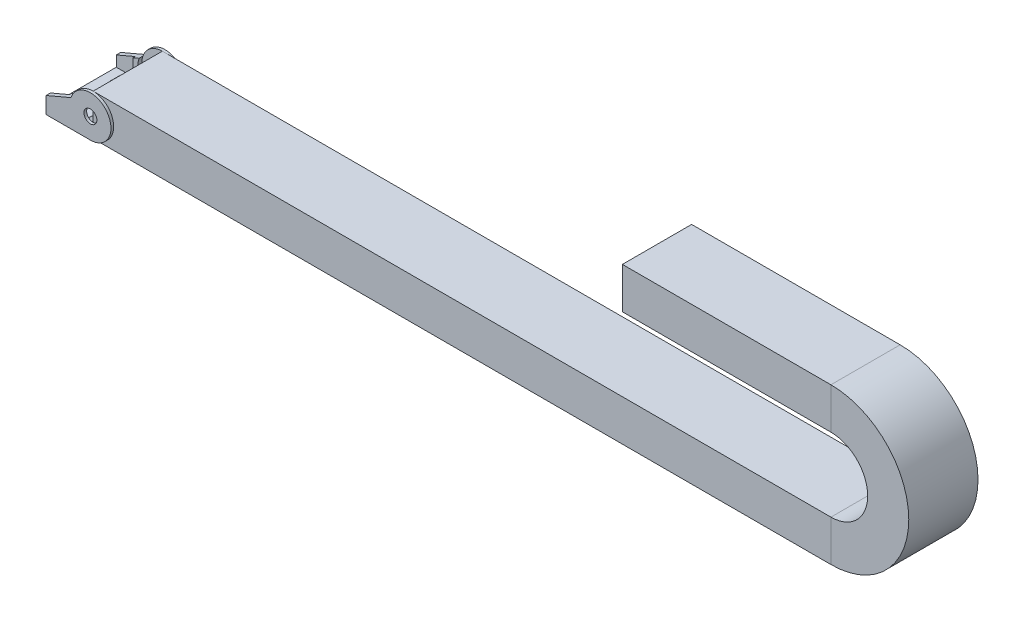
ISO-10303-21;
HEADER;
FILE_DESCRIPTION(('STEP AP214'),'2;1');
FILE_NAME('part.step','',(''),(''),'','','');
FILE_SCHEMA(('AUTOMOTIVE_DESIGN { 1 0 10303 214 1 1 1 1 }'));
ENDSEC;
DATA;
#1=APPLICATION_CONTEXT('core data for automotive mechanical design processes');
#2=APPLICATION_PROTOCOL_DEFINITION('international standard','automotive_design',2000,#1);
#3=PRODUCT_CONTEXT('',#1,'mechanical');
#4=PRODUCT('Part','Part','',(#3));
#5=PRODUCT_RELATED_PRODUCT_CATEGORY('part','',(#4));
#6=PRODUCT_DEFINITION_FORMATION('','',#4);
#7=PRODUCT_DEFINITION_CONTEXT('part definition',#1,'design');
#8=PRODUCT_DEFINITION('design','',#6,#7);
#9=PRODUCT_DEFINITION_SHAPE('','',#8);
#10=(LENGTH_UNIT() NAMED_UNIT(*) SI_UNIT(.MILLI.,.METRE.));
#11=(NAMED_UNIT(*) PLANE_ANGLE_UNIT() SI_UNIT($,.RADIAN.));
#12=(NAMED_UNIT(*) SI_UNIT($,.STERADIAN.) SOLID_ANGLE_UNIT());
#13=UNCERTAINTY_MEASURE_WITH_UNIT(LENGTH_MEASURE(1.E-05),#10,'distance_accuracy_value','');
#14=(GEOMETRIC_REPRESENTATION_CONTEXT(3) GLOBAL_UNCERTAINTY_ASSIGNED_CONTEXT((#13)) GLOBAL_UNIT_ASSIGNED_CONTEXT((#10,
#11,#12)) REPRESENTATION_CONTEXT('',''));
#15=CARTESIAN_POINT('',(0.,0.,0.));
#16=DIRECTION('',(0.,0.,1.));
#17=DIRECTION('',(1.,0.,0.));
#18=AXIS2_PLACEMENT_3D('',#15,#16,#17);
#19=CARTESIAN_POINT('',(0.,0.,42.164));
#20=DIRECTION('',(0.,0.,1.));
#21=DIRECTION('',(1.,0.,0.));
#22=AXIS2_PLACEMENT_3D('',#19,#20,#21);
#23=PLANE('',#22);
#24=DIRECTION('',(0.,-1.,0.));
#25=VECTOR('',#24,1.);
#26=CARTESIAN_POINT('',(-76.2,25.019,42.164));
#27=LINE('',#26,#25);
#28=CARTESIAN_POINT('',(-76.2,-7.874,42.164));
#29=VERTEX_POINT('',#28);
#30=CARTESIAN_POINT('',(-76.2,-25.019,42.164));
#31=VERTEX_POINT('',#30);
#32=EDGE_CURVE('E368',#29,#31,#27,.T.);
#33=ORIENTED_EDGE('',*,*,#32,.T.);
#34=DIRECTION('',(1.,0.,0.));
#35=VECTOR('',#34,1.);
#36=CARTESIAN_POINT('',(-86.6480176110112,-25.019,42.164));
#37=LINE('',#36,#35);
#38=CARTESIAN_POINT('',(-86.6480176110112,-25.019,42.164));
#39=VERTEX_POINT('',#38);
#40=EDGE_CURVE('E440',#39,#31,#37,.T.);
#41=ORIENTED_EDGE('',*,*,#40,.F.);
#42=DIRECTION('',(0.,-1.,0.));
#43=VECTOR('',#42,1.);
#44=CARTESIAN_POINT('',(-86.6480176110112,-22.733,42.164));
#45=LINE('',#44,#43);
#46=CARTESIAN_POINT('',(-86.6480176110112,-22.733,42.164));
#47=VERTEX_POINT('',#46);
#48=EDGE_CURVE('E444',#47,#39,#45,.T.);
#49=ORIENTED_EDGE('',*,*,#48,.F.);
#50=CARTESIAN_POINT('',(-76.2,0.,42.164));
#51=DIRECTION('',(0.,0.,1.));
#52=DIRECTION('',(1.,0.,0.));
#53=AXIS2_PLACEMENT_3D('',#50,#51,#52);
#54=CIRCLE('',#53,25.019);
#55=CARTESIAN_POINT('',(-99.9051547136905,8.001,42.164));
#56=VERTEX_POINT('',#55);
#57=EDGE_CURVE('E449',#56,#47,#54,.T.);
#58=ORIENTED_EDGE('',*,*,#57,.F.);
#59=CARTESIAN_POINT('',(-76.2,25.019,42.164));
#60=VERTEX_POINT('',#59);
#61=EDGE_CURVE('E51',#60,#56,#54,.T.);
#62=ORIENTED_EDGE('',*,*,#61,.F.);
#63=CARTESIAN_POINT('',(-76.2,7.874,42.164));
#64=VERTEX_POINT('',#63);
#65=EDGE_CURVE('E364',#60,#64,#27,.T.);
#66=ORIENTED_EDGE('',*,*,#65,.T.);
#67=CARTESIAN_POINT('',(-76.2,0.,42.164));
#68=DIRECTION('',(0.,0.,1.));
#69=DIRECTION('',(1.,0.,0.));
#70=AXIS2_PLACEMENT_3D('',#67,#68,#69);
#71=CIRCLE('',#70,7.874);
#72=EDGE_CURVE('E425',#64,#29,#71,.T.);
#73=ORIENTED_EDGE('',*,*,#72,.T.);
#74=EDGE_LOOP('',(#33,#41,#49,#58,#62,#66,#73));
#75=FACE_BOUND('',#74,.T.);
#76=ADVANCED_FACE('F35',(#75),#23,.F.);
#77=CARTESIAN_POINT('',(0.,0.,-42.164));
#78=DIRECTION('',(0.,0.,-1.));
#79=DIRECTION('',(1.,0.,0.));
#80=AXIS2_PLACEMENT_3D('',#77,#78,#79);
#81=PLANE('',#80);
#82=DIRECTION('',(0.,1.,0.));
#83=VECTOR('',#82,1.);
#84=CARTESIAN_POINT('',(-76.2,25.019,-42.164));
#85=LINE('',#84,#83);
#86=CARTESIAN_POINT('',(-76.2,7.874,-42.164));
#87=VERTEX_POINT('',#86);
#88=CARTESIAN_POINT('',(-76.2,25.019,-42.164));
#89=VERTEX_POINT('',#88);
#90=EDGE_CURVE('E59',#87,#89,#85,.T.);
#91=ORIENTED_EDGE('',*,*,#90,.T.);
#92=CARTESIAN_POINT('',(-76.2,0.,-42.164));
#93=DIRECTION('',(0.,0.,-1.));
#94=DIRECTION('',(-1.,0.,0.));
#95=AXIS2_PLACEMENT_3D('',#92,#93,#94);
#96=CIRCLE('',#95,25.019);
#97=CARTESIAN_POINT('',(-99.9051547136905,8.001,-42.164));
#98=VERTEX_POINT('',#97);
#99=EDGE_CURVE('E437',#89,#98,#96,.F.);
#100=ORIENTED_EDGE('',*,*,#99,.T.);
#101=CARTESIAN_POINT('',(-86.6480176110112,-22.733,-42.164));
#102=VERTEX_POINT('',#101);
#103=EDGE_CURVE('E438',#98,#102,#96,.F.);
#104=ORIENTED_EDGE('',*,*,#103,.T.);
#105=DIRECTION('',(0.,-1.,0.));
#106=VECTOR('',#105,1.);
#107=CARTESIAN_POINT('',(-86.6480176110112,-22.733,-42.164));
#108=LINE('',#107,#106);
#109=CARTESIAN_POINT('',(-86.6480176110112,-25.019,-42.164));
#110=VERTEX_POINT('',#109);
#111=EDGE_CURVE('E428',#102,#110,#108,.T.);
#112=ORIENTED_EDGE('',*,*,#111,.T.);
#113=DIRECTION('',(1.,0.,0.));
#114=VECTOR('',#113,1.);
#115=CARTESIAN_POINT('',(-86.6480176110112,-25.019,-42.164));
#116=LINE('',#115,#114);
#117=CARTESIAN_POINT('',(-76.2,-25.019,-42.164));
#118=VERTEX_POINT('',#117);
#119=EDGE_CURVE('E432',#110,#118,#116,.T.);
#120=ORIENTED_EDGE('',*,*,#119,.T.);
#121=CARTESIAN_POINT('',(-76.2,-7.874,-42.164));
#122=VERTEX_POINT('',#121);
#123=EDGE_CURVE('E405',#118,#122,#85,.T.);
#124=ORIENTED_EDGE('',*,*,#123,.T.);
#125=CARTESIAN_POINT('',(-76.2,0.,-42.164));
#126=DIRECTION('',(0.,0.,-1.));
#127=DIRECTION('',(-1.,0.,0.));
#128=AXIS2_PLACEMENT_3D('',#125,#126,#127);
#129=CIRCLE('',#128,7.874);
#130=EDGE_CURVE('E422',#122,#87,#129,.T.);
#131=ORIENTED_EDGE('',*,*,#130,.T.);
#132=EDGE_LOOP('',(#91,#100,#104,#112,#120,#124,#131));
#133=FACE_BOUND('',#132,.T.);
#134=ADVANCED_FACE('F735',(#133),#81,.F.);
#135=CARTESIAN_POINT('',(-107.188,-17.907,77.9358962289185));
#136=DIRECTION('',(0.,1.,0.));
#137=DIRECTION('',(0.,0.,1.));
#138=AXIS2_PLACEMENT_3D('',#135,#136,#137);
#139=PLANE('',#138);
#140=DIRECTION('',(0.,0.,-1.));
#141=VECTOR('',#140,1.);
#142=CARTESIAN_POINT('',(-107.188,-17.907,33.274));
#143=LINE('',#142,#141);
#144=CARTESIAN_POINT('',(-107.188,-17.907,33.274));
#145=VERTEX_POINT('',#144);
#146=CARTESIAN_POINT('',(-107.188,-17.907,21.844));
#147=VERTEX_POINT('',#146);
#148=EDGE_CURVE('E523',#145,#147,#143,.T.);
#149=ORIENTED_EDGE('',*,*,#148,.F.);
#150=CARTESIAN_POINT('',(-113.284,-17.907,33.274));
#151=DIRECTION('',(0.,-1.,0.));
#152=DIRECTION('',(0.,0.,1.));
#153=AXIS2_PLACEMENT_3D('',#150,#151,#152);
#154=CIRCLE('',#153,6.09600000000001);
#155=CARTESIAN_POINT('',(-119.38,-17.907,33.274));
#156=VERTEX_POINT('',#155);
#157=EDGE_CURVE('E532',#156,#145,#154,.F.);
#158=ORIENTED_EDGE('',*,*,#157,.F.);
#159=DIRECTION('',(0.,0.,1.));
#160=VECTOR('',#159,1.);
#161=CARTESIAN_POINT('',(-119.38,-17.907,21.844));
#162=LINE('',#161,#160);
#163=CARTESIAN_POINT('',(-119.38,-17.907,21.844));
#164=VERTEX_POINT('',#163);
#165=EDGE_CURVE('E537',#164,#156,#162,.T.);
#166=ORIENTED_EDGE('',*,*,#165,.F.);
#167=CARTESIAN_POINT('',(-113.284,-17.907,21.844));
#168=DIRECTION('',(0.,-1.,0.));
#169=DIRECTION('',(0.,0.,1.));
#170=AXIS2_PLACEMENT_3D('',#167,#168,#169);
#171=CIRCLE('',#170,6.09600000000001);
#172=EDGE_CURVE('E541',#147,#164,#171,.F.);
#173=ORIENTED_EDGE('',*,*,#172,.F.);
#174=EDGE_LOOP('',(#149,#158,#166,#173));
#175=FACE_BOUND('',#174,.T.);
#176=DIRECTION('',(0.,0.,-1.));
#177=VECTOR('',#176,1.);
#178=CARTESIAN_POINT('',(-107.188,-17.907,-33.274));
#179=LINE('',#178,#177);
#180=CARTESIAN_POINT('',(-107.188,-17.907,-33.274));
#181=VERTEX_POINT('',#180);
#182=CARTESIAN_POINT('',(-107.188,-17.907,-21.844));
#183=VERTEX_POINT('',#182);
#184=EDGE_CURVE('E481',#181,#183,#179,.F.);
#185=ORIENTED_EDGE('',*,*,#184,.T.);
#186=CARTESIAN_POINT('',(-113.284,-17.907,-21.844));
#187=DIRECTION('',(0.,-1.,0.));
#188=DIRECTION('',(0.,0.,1.));
#189=AXIS2_PLACEMENT_3D('',#186,#187,#188);
#190=CIRCLE('',#189,6.09600000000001);
#191=CARTESIAN_POINT('',(-119.38,-17.907,-21.844));
#192=VERTEX_POINT('',#191);
#193=EDGE_CURVE('E477',#183,#192,#190,.T.);
#194=ORIENTED_EDGE('',*,*,#193,.T.);
#195=DIRECTION('',(0.,0.,1.));
#196=VECTOR('',#195,1.);
#197=CARTESIAN_POINT('',(-119.38,-17.907,-21.844));
#198=LINE('',#197,#196);
#199=CARTESIAN_POINT('',(-119.38,-17.907,-33.274));
#200=VERTEX_POINT('',#199);
#201=EDGE_CURVE('E487',#192,#200,#198,.F.);
#202=ORIENTED_EDGE('',*,*,#201,.T.);
#203=CARTESIAN_POINT('',(-113.284,-17.907,-33.274));
#204=DIRECTION('',(0.,-1.,0.));
#205=DIRECTION('',(0.,0.,1.));
#206=AXIS2_PLACEMENT_3D('',#203,#204,#205);
#207=CIRCLE('',#206,6.09600000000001);
#208=EDGE_CURVE('E484',#200,#181,#207,.T.);
#209=ORIENTED_EDGE('',*,*,#208,.T.);
#210=EDGE_LOOP('',(#185,#194,#202,#209));
#211=FACE_BOUND('',#210,.T.);
#212=DIRECTION('',(-1.,0.,0.));
#213=VECTOR('',#212,1.);
#214=CARTESIAN_POINT('',(-90.424,-17.907,37.465));
#215=LINE('',#214,#213);
#216=CARTESIAN_POINT('',(-93.6725416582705,-17.907,37.465));
#217=VERTEX_POINT('',#216);
#218=CARTESIAN_POINT('',(-107.188,-17.907,37.465));
#219=VERTEX_POINT('',#218);
#220=EDGE_CURVE('E624',#217,#219,#215,.T.);
#221=ORIENTED_EDGE('',*,*,#220,.F.);
#222=DIRECTION('',(0.,0.,-1.));
#223=VECTOR('',#222,1.);
#224=CARTESIAN_POINT('',(-93.6725416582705,-17.907,112.928418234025));
#225=LINE('',#224,#223);
#226=CARTESIAN_POINT('',(-93.6725416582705,-17.907,-37.4649999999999));
#227=VERTEX_POINT('',#226);
#228=EDGE_CURVE('E443',#217,#227,#225,.T.);
#229=ORIENTED_EDGE('',*,*,#228,.T.);
#230=DIRECTION('',(-1.,0.,0.));
#231=VECTOR('',#230,1.);
#232=CARTESIAN_POINT('',(-90.424,-17.907,-37.465));
#233=LINE('',#232,#231);
#234=CARTESIAN_POINT('',(-107.188,-17.907,-37.465));
#235=VERTEX_POINT('',#234);
#236=EDGE_CURVE('E614',#227,#235,#233,.T.);
#237=ORIENTED_EDGE('',*,*,#236,.T.);
#238=DIRECTION('',(0.,0.,-1.));
#239=VECTOR('',#238,1.);
#240=CARTESIAN_POINT('',(-107.188,-17.907,77.9358962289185));
#241=LINE('',#240,#239);
#242=CARTESIAN_POINT('',(-107.188,-17.907,-40.132));
#243=VERTEX_POINT('',#242);
#244=EDGE_CURVE('E663',#235,#243,#241,.T.);
#245=ORIENTED_EDGE('',*,*,#244,.T.);
#246=DIRECTION('',(1.,0.,0.));
#247=VECTOR('',#246,1.);
#248=CARTESIAN_POINT('',(-107.188,-17.907,-40.132));
#249=LINE('',#248,#247);
#250=CARTESIAN_POINT('',(-130.302,-17.907,-40.132));
#251=VERTEX_POINT('',#250);
#252=EDGE_CURVE('E636',#251,#243,#249,.T.);
#253=ORIENTED_EDGE('',*,*,#252,.F.);
#254=DIRECTION('',(0.,0.,-1.));
#255=VECTOR('',#254,1.);
#256=CARTESIAN_POINT('',(-130.302,-17.907,77.9358962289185));
#257=LINE('',#256,#255);
#258=CARTESIAN_POINT('',(-130.302,-17.907,40.132));
#259=VERTEX_POINT('',#258);
#260=EDGE_CURVE('E659',#259,#251,#257,.T.);
#261=ORIENTED_EDGE('',*,*,#260,.F.);
#262=DIRECTION('',(-1.,0.,0.));
#263=VECTOR('',#262,1.);
#264=CARTESIAN_POINT('',(-107.188,-17.907,40.132));
#265=LINE('',#264,#263);
#266=CARTESIAN_POINT('',(-107.188,-17.907,40.132));
#267=VERTEX_POINT('',#266);
#268=EDGE_CURVE('E647',#267,#259,#265,.T.);
#269=ORIENTED_EDGE('',*,*,#268,.F.);
#270=EDGE_CURVE('E664',#267,#219,#241,.T.);
#271=ORIENTED_EDGE('',*,*,#270,.T.);
#272=EDGE_LOOP('',(#221,#229,#237,#245,#253,#261,#269,#271));
#273=FACE_BOUND('',#272,.T.);
#274=ADVANCED_FACE('F802',(#175,#211,#273),#139,.T.);
#275=CARTESIAN_POINT('',(-76.2,-25.019,45.466));
#276=DIRECTION('',(0.,1.,0.));
#277=DIRECTION('',(0.,0.,1.));
#278=AXIS2_PLACEMENT_3D('',#275,#276,#277);
#279=PLANE('',#278);
#280=DIRECTION('',(0.,0.,-1.));
#281=VECTOR('',#280,1.);
#282=CARTESIAN_POINT('',(-110.236,-25.019,33.274));
#283=LINE('',#282,#281);
#284=CARTESIAN_POINT('',(-110.236,-25.019,33.274));
#285=VERTEX_POINT('',#284);
#286=CARTESIAN_POINT('',(-110.236,-25.019,21.844));
#287=VERTEX_POINT('',#286);
#288=EDGE_CURVE('E565',#285,#287,#283,.T.);
#289=ORIENTED_EDGE('',*,*,#288,.T.);
#290=CARTESIAN_POINT('',(-113.284,-25.019,21.844));
#291=DIRECTION('',(0.,1.,0.));
#292=DIRECTION('',(0.,0.,-1.));
#293=AXIS2_PLACEMENT_3D('',#290,#291,#292);
#294=CIRCLE('',#293,3.048);
#295=CARTESIAN_POINT('',(-116.332,-25.019,21.844));
#296=VERTEX_POINT('',#295);
#297=EDGE_CURVE('E568',#287,#296,#294,.T.);
#298=ORIENTED_EDGE('',*,*,#297,.T.);
#299=DIRECTION('',(0.,0.,1.));
#300=VECTOR('',#299,1.);
#301=CARTESIAN_POINT('',(-116.332,-25.019,33.274));
#302=LINE('',#301,#300);
#303=CARTESIAN_POINT('',(-116.332,-25.019,33.274));
#304=VERTEX_POINT('',#303);
#305=EDGE_CURVE('E553',#296,#304,#302,.T.);
#306=ORIENTED_EDGE('',*,*,#305,.T.);
#307=CARTESIAN_POINT('',(-113.284,-25.019,33.274));
#308=DIRECTION('',(0.,1.,0.));
#309=DIRECTION('',(0.,0.,-1.));
#310=AXIS2_PLACEMENT_3D('',#307,#308,#309);
#311=CIRCLE('',#310,3.048);
#312=EDGE_CURVE('E548',#304,#285,#311,.T.);
#313=ORIENTED_EDGE('',*,*,#312,.T.);
#314=EDGE_LOOP('',(#289,#298,#306,#313));
#315=FACE_BOUND('',#314,.T.);
#316=CARTESIAN_POINT('',(-113.284,-25.019,-33.274));
#317=DIRECTION('',(0.,-1.,0.));
#318=DIRECTION('',(0.,0.,1.));
#319=AXIS2_PLACEMENT_3D('',#316,#317,#318);
#320=CIRCLE('',#319,3.048);
#321=CARTESIAN_POINT('',(-116.332,-25.019,-33.274));
#322=VERTEX_POINT('',#321);
#323=CARTESIAN_POINT('',(-110.236,-25.019,-33.274));
#324=VERTEX_POINT('',#323);
#325=EDGE_CURVE('E480',#322,#324,#320,.T.);
#326=ORIENTED_EDGE('',*,*,#325,.F.);
#327=DIRECTION('',(0.,0.,-1.));
#328=VECTOR('',#327,1.);
#329=CARTESIAN_POINT('',(-116.332,-25.019,-33.274));
#330=LINE('',#329,#328);
#331=CARTESIAN_POINT('',(-116.332,-25.019,-21.844));
#332=VERTEX_POINT('',#331);
#333=EDGE_CURVE('E513',#332,#322,#330,.T.);
#334=ORIENTED_EDGE('',*,*,#333,.F.);
#335=CARTESIAN_POINT('',(-113.284,-25.019,-21.844));
#336=DIRECTION('',(0.,-1.,0.));
#337=DIRECTION('',(0.,0.,1.));
#338=AXIS2_PLACEMENT_3D('',#335,#336,#337);
#339=CIRCLE('',#338,3.048);
#340=CARTESIAN_POINT('',(-110.236,-25.019,-21.844));
#341=VERTEX_POINT('',#340);
#342=EDGE_CURVE('E516',#341,#332,#339,.T.);
#343=ORIENTED_EDGE('',*,*,#342,.F.);
#344=DIRECTION('',(0.,0.,1.));
#345=VECTOR('',#344,1.);
#346=CARTESIAN_POINT('',(-110.236,-25.019,-33.274));
#347=LINE('',#346,#345);
#348=EDGE_CURVE('E501',#324,#341,#347,.T.);
#349=ORIENTED_EDGE('',*,*,#348,.F.);
#350=EDGE_LOOP('',(#326,#334,#343,#349));
#351=FACE_BOUND('',#350,.T.);
#352=DIRECTION('',(0.,0.,-1.));
#353=VECTOR('',#352,1.);
#354=CARTESIAN_POINT('',(-86.6480176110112,-25.019,112.928418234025));
#355=LINE('',#354,#353);
#356=CARTESIAN_POINT('',(-86.6480176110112,-25.019,37.465));
#357=VERTEX_POINT('',#356);
#358=EDGE_CURVE('E454',#39,#357,#355,.T.);
#359=ORIENTED_EDGE('',*,*,#358,.F.);
#360=ORIENTED_EDGE('',*,*,#40,.T.);
#361=DIRECTION('',(0.,0.,-1.));
#362=VECTOR('',#361,1.);
#363=CARTESIAN_POINT('',(-76.2,-25.019,45.466));
#364=LINE('',#363,#362);
#365=CARTESIAN_POINT('',(-76.2,-25.019,45.466));
#366=VERTEX_POINT('',#365);
#367=EDGE_CURVE('E700',#366,#31,#364,.T.);
#368=ORIENTED_EDGE('',*,*,#367,.F.);
#369=DIRECTION('',(-1.,0.,0.));
#370=VECTOR('',#369,1.);
#371=CARTESIAN_POINT('',(-76.2,-25.019,45.466));
#372=LINE('',#371,#370);
#373=CARTESIAN_POINT('',(-130.302,-25.019,45.466));
#374=VERTEX_POINT('',#373);
#375=EDGE_CURVE('E669',#366,#374,#372,.T.);
#376=ORIENTED_EDGE('',*,*,#375,.T.);
#377=DIRECTION('',(0.,0.,-1.));
#378=VECTOR('',#377,1.);
#379=CARTESIAN_POINT('',(-130.302,-25.019,45.466));
#380=LINE('',#379,#378);
#381=CARTESIAN_POINT('',(-130.302,-25.019,40.132));
#382=VERTEX_POINT('',#381);
#383=EDGE_CURVE('E696',#374,#382,#380,.T.);
#384=ORIENTED_EDGE('',*,*,#383,.T.);
#385=DIRECTION('',(1.,0.,0.));
#386=VECTOR('',#385,1.);
#387=CARTESIAN_POINT('',(-120.396,-25.019,40.132));
#388=LINE('',#387,#386);
#389=CARTESIAN_POINT('',(-120.396,-25.019,40.132));
#390=VERTEX_POINT('',#389);
#391=EDGE_CURVE('E585',#382,#390,#388,.T.);
#392=ORIENTED_EDGE('',*,*,#391,.T.);
#393=DIRECTION('',(0.,0.,-1.));
#394=VECTOR('',#393,1.);
#395=CARTESIAN_POINT('',(-120.396,-25.019,-40.132));
#396=LINE('',#395,#394);
#397=CARTESIAN_POINT('',(-120.396,-25.019,-40.132));
#398=VERTEX_POINT('',#397);
#399=EDGE_CURVE('E575',#390,#398,#396,.T.);
#400=ORIENTED_EDGE('',*,*,#399,.T.);
#401=DIRECTION('',(-1.,0.,0.));
#402=VECTOR('',#401,1.);
#403=CARTESIAN_POINT('',(-120.396,-25.019,-40.132));
#404=LINE('',#403,#402);
#405=CARTESIAN_POINT('',(-130.302,-25.019,-40.132));
#406=VERTEX_POINT('',#405);
#407=EDGE_CURVE('E595',#398,#406,#404,.T.);
#408=ORIENTED_EDGE('',*,*,#407,.T.);
#409=CARTESIAN_POINT('',(-130.302,-25.019,-45.466));
#410=VERTEX_POINT('',#409);
#411=EDGE_CURVE('E695',#406,#410,#380,.T.);
#412=ORIENTED_EDGE('',*,*,#411,.T.);
#413=DIRECTION('',(-1.,0.,0.));
#414=VECTOR('',#413,1.);
#415=CARTESIAN_POINT('',(-76.2,-25.019,-45.466));
#416=LINE('',#415,#414);
#417=CARTESIAN_POINT('',(-76.2,-25.019,-45.466));
#418=VERTEX_POINT('',#417);
#419=EDGE_CURVE('E650',#418,#410,#416,.T.);
#420=ORIENTED_EDGE('',*,*,#419,.F.);
#421=EDGE_CURVE('E699',#118,#418,#364,.T.);
#422=ORIENTED_EDGE('',*,*,#421,.F.);
#423=ORIENTED_EDGE('',*,*,#119,.F.);
#424=CARTESIAN_POINT('',(-86.6480176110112,-25.019,-37.4649999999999));
#425=VERTEX_POINT('',#424);
#426=EDGE_CURVE('E453',#425,#110,#355,.T.);
#427=ORIENTED_EDGE('',*,*,#426,.F.);
#428=DIRECTION('',(-1.,0.,0.));
#429=VECTOR('',#428,1.);
#430=CARTESIAN_POINT('',(-76.2,-25.019,-37.465));
#431=LINE('',#430,#429);
#432=CARTESIAN_POINT('',(-90.424,-25.019,-37.465));
#433=VERTEX_POINT('',#432);
#434=EDGE_CURVE('E608',#425,#433,#431,.T.);
#435=ORIENTED_EDGE('',*,*,#434,.T.);
#436=DIRECTION('',(0.,0.,1.));
#437=VECTOR('',#436,1.);
#438=CARTESIAN_POINT('',(-90.424,-25.019,-37.465));
#439=LINE('',#438,#437);
#440=CARTESIAN_POINT('',(-90.424,-25.019,37.465));
#441=VERTEX_POINT('',#440);
#442=EDGE_CURVE('E619',#433,#441,#439,.T.);
#443=ORIENTED_EDGE('',*,*,#442,.T.);
#444=DIRECTION('',(-1.,0.,0.));
#445=VECTOR('',#444,1.);
#446=CARTESIAN_POINT('',(-76.2,-25.019,37.465));
#447=LINE('',#446,#445);
#448=EDGE_CURVE('E602',#357,#441,#447,.T.);
#449=ORIENTED_EDGE('',*,*,#448,.F.);
#450=EDGE_LOOP('',(#359,#360,#368,#376,#384,#392,#400,#408,#412,#420,#422,#423,#427,#435,#443,#449));
#451=FACE_BOUND('',#450,.T.);
#452=ADVANCED_FACE('F723',(#315,#351,#451),#279,.F.);
#453=CARTESIAN_POINT('',(-90.424,-25.019,-37.465));
#454=DIRECTION('',(-1.,0.,0.));
#455=DIRECTION('',(0.,0.,-1.));
#456=AXIS2_PLACEMENT_3D('',#453,#454,#455);
#457=PLANE('',#456);
#458=DIRECTION('',(0.,0.,-1.));
#459=VECTOR('',#458,1.);
#460=CARTESIAN_POINT('',(-90.424,-20.5822298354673,112.928418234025));
#461=LINE('',#460,#459);
#462=CARTESIAN_POINT('',(-90.424,-20.5822298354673,37.465));
#463=VERTEX_POINT('',#462);
#464=CARTESIAN_POINT('',(-90.424,-20.5822298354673,-37.465));
#465=VERTEX_POINT('',#464);
#466=EDGE_CURVE('E461',#463,#465,#461,.T.);
#467=ORIENTED_EDGE('',*,*,#466,.F.);
#468=DIRECTION('',(0.,1.,0.));
#469=VECTOR('',#468,1.);
#470=CARTESIAN_POINT('',(-90.424,-25.019,37.465));
#471=LINE('',#470,#469);
#472=EDGE_CURVE('E621',#441,#463,#471,.T.);
#473=ORIENTED_EDGE('',*,*,#472,.F.);
#474=ORIENTED_EDGE('',*,*,#442,.F.);
#475=DIRECTION('',(0.,1.,0.));
#476=VECTOR('',#475,1.);
#477=CARTESIAN_POINT('',(-90.424,-25.019,-37.465));
#478=LINE('',#477,#476);
#479=EDGE_CURVE('E610',#433,#465,#478,.T.);
#480=ORIENTED_EDGE('',*,*,#479,.T.);
#481=EDGE_LOOP('',(#467,#473,#474,#480));
#482=FACE_BOUND('',#481,.T.);
#483=ADVANCED_FACE('F716',(#482),#457,.F.);
#484=CARTESIAN_POINT('',(-76.2,0.,-37.465));
#485=DIRECTION('',(0.,0.,1.));
#486=DIRECTION('',(-1.,0.,0.));
#487=AXIS2_PLACEMENT_3D('',#484,#485,#486);
#488=PLANE('',#487);
#489=ORIENTED_EDGE('',*,*,#434,.F.);
#490=DIRECTION('',(0.,1.,0.));
#491=VECTOR('',#490,1.);
#492=CARTESIAN_POINT('',(-86.6480176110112,0.,-37.465));
#493=LINE('',#492,#491);
#494=CARTESIAN_POINT('',(-86.6480176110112,-22.733,-37.4649999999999));
#495=VERTEX_POINT('',#494);
#496=EDGE_CURVE('E467',#425,#495,#493,.T.);
#497=ORIENTED_EDGE('',*,*,#496,.T.);
#498=CARTESIAN_POINT('',(-76.2,0.,-37.465));
#499=DIRECTION('',(0.,0.,1.));
#500=DIRECTION('',(1.,0.,0.));
#501=AXIS2_PLACEMENT_3D('',#498,#499,#500);
#502=CIRCLE('',#501,25.019);
#503=EDGE_CURVE('E462',#495,#465,#502,.F.);
#504=ORIENTED_EDGE('',*,*,#503,.T.);
#505=ORIENTED_EDGE('',*,*,#479,.F.);
#506=EDGE_LOOP('',(#489,#497,#504,#505));
#507=FACE_BOUND('',#506,.T.);
#508=ADVANCED_FACE('F728',(#507),#488,.T.);
#509=ORIENTED_EDGE('',*,*,#236,.F.);
#510=CARTESIAN_POINT('',(-99.9051547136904,8.001,-37.465));
#511=VERTEX_POINT('',#510);
#512=EDGE_CURVE('E458',#227,#511,#502,.F.);
#513=ORIENTED_EDGE('',*,*,#512,.T.);
#514=DIRECTION('',(0.919945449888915,0.392046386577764,0.));
#515=VECTOR('',#514,1.);
#516=CARTESIAN_POINT('',(-130.302,-4.953,-37.465));
#517=LINE('',#516,#515);
#518=CARTESIAN_POINT('',(-107.188,4.89732338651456,-37.465));
#519=VERTEX_POINT('',#518);
#520=EDGE_CURVE('E616',#519,#511,#517,.T.);
#521=ORIENTED_EDGE('',*,*,#520,.F.);
#522=DIRECTION('',(0.,-1.,0.));
#523=VECTOR('',#522,1.);
#524=CARTESIAN_POINT('',(-107.188,4.89732338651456,-37.465));
#525=LINE('',#524,#523);
#526=EDGE_CURVE('E633',#519,#235,#525,.T.);
#527=ORIENTED_EDGE('',*,*,#526,.T.);
#528=EDGE_LOOP('',(#509,#513,#521,#527));
#529=FACE_BOUND('',#528,.T.);
#530=ADVANCED_FACE('F891',(#529),#488,.T.);
#531=CARTESIAN_POINT('',(-76.2,0.,37.465));
#532=DIRECTION('',(0.,0.,1.));
#533=DIRECTION('',(-1.,0.,0.));
#534=AXIS2_PLACEMENT_3D('',#531,#532,#533);
#535=PLANE('',#534);
#536=DIRECTION('',(0.,1.,0.));
#537=VECTOR('',#536,1.);
#538=CARTESIAN_POINT('',(-86.6480176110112,0.,37.465));
#539=LINE('',#538,#537);
#540=CARTESIAN_POINT('',(-86.6480176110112,-22.733,37.465));
#541=VERTEX_POINT('',#540);
#542=EDGE_CURVE('E12',#357,#541,#539,.T.);
#543=ORIENTED_EDGE('',*,*,#542,.F.);
#544=ORIENTED_EDGE('',*,*,#448,.T.);
#545=ORIENTED_EDGE('',*,*,#472,.T.);
#546=CARTESIAN_POINT('',(-76.2,0.,37.465));
#547=DIRECTION('',(0.,0.,1.));
#548=DIRECTION('',(1.,0.,0.));
#549=AXIS2_PLACEMENT_3D('',#546,#547,#548);
#550=CIRCLE('',#549,25.019);
#551=EDGE_CURVE('E44',#541,#463,#550,.F.);
#552=ORIENTED_EDGE('',*,*,#551,.F.);
#553=EDGE_LOOP('',(#543,#544,#545,#552));
#554=FACE_BOUND('',#553,.T.);
#555=ADVANCED_FACE('F719',(#554),#535,.F.);
#556=CARTESIAN_POINT('',(-99.9051547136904,8.001,37.465));
#557=VERTEX_POINT('',#556);
#558=EDGE_CURVE('E703',#217,#557,#550,.F.);
#559=ORIENTED_EDGE('',*,*,#558,.F.);
#560=ORIENTED_EDGE('',*,*,#220,.T.);
#561=DIRECTION('',(0.,-1.,0.));
#562=VECTOR('',#561,1.);
#563=CARTESIAN_POINT('',(-107.188,4.89732338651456,37.465));
#564=LINE('',#563,#562);
#565=CARTESIAN_POINT('',(-107.188,4.89732338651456,37.465));
#566=VERTEX_POINT('',#565);
#567=EDGE_CURVE('E630',#566,#219,#564,.T.);
#568=ORIENTED_EDGE('',*,*,#567,.F.);
#569=DIRECTION('',(0.919945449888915,0.392046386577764,0.));
#570=VECTOR('',#569,1.);
#571=CARTESIAN_POINT('',(-130.302,-4.953,37.465));
#572=LINE('',#571,#570);
#573=EDGE_CURVE('E611',#566,#557,#572,.T.);
#574=ORIENTED_EDGE('',*,*,#573,.T.);
#575=EDGE_LOOP('',(#559,#560,#568,#574));
#576=FACE_BOUND('',#575,.T.);
#577=ADVANCED_FACE('F894',(#576),#535,.F.);
#578=CARTESIAN_POINT('',(-76.2,0.,45.466));
#579=DIRECTION('',(0.,0.,-1.));
#580=DIRECTION('',(1.,0.,0.));
#581=AXIS2_PLACEMENT_3D('',#578,#579,#580);
#582=CYLINDRICAL_SURFACE('',#581,25.019);
#583=DIRECTION('',(0.,0.,-1.));
#584=VECTOR('',#583,1.);
#585=CARTESIAN_POINT('',(-99.9051547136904,8.001,45.466));
#586=LINE('',#585,#584);
#587=CARTESIAN_POINT('',(-99.9051547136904,8.001,-45.466));
#588=VERTEX_POINT('',#587);
#589=EDGE_CURVE('E679',#98,#588,#586,.T.);
#590=ORIENTED_EDGE('',*,*,#589,.F.);
#591=ORIENTED_EDGE('',*,*,#99,.F.);
#592=EDGE_CURVE('E433',#118,#89,#96,.F.);
#593=ORIENTED_EDGE('',*,*,#592,.F.);
#594=ORIENTED_EDGE('',*,*,#421,.T.);
#595=CARTESIAN_POINT('',(-76.2,0.,-45.466));
#596=DIRECTION('',(0.,0.,1.));
#597=DIRECTION('',(1.,0.,0.));
#598=AXIS2_PLACEMENT_3D('',#595,#596,#597);
#599=CIRCLE('',#598,25.019);
#600=EDGE_CURVE('E470',#418,#588,#599,.T.);
#601=ORIENTED_EDGE('',*,*,#600,.T.);
#602=EDGE_LOOP('',(#590,#591,#593,#594,#601));
#603=FACE_BOUND('',#602,.T.);
#604=ADVANCED_FACE('F1160',(#603),#582,.T.);
#605=ORIENTED_EDGE('',*,*,#367,.T.);
#606=EDGE_CURVE('E447',#31,#60,#54,.T.);
#607=ORIENTED_EDGE('',*,*,#606,.T.);
#608=ORIENTED_EDGE('',*,*,#61,.T.);
#609=CARTESIAN_POINT('',(-99.9051547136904,8.001,45.466));
#610=VERTEX_POINT('',#609);
#611=EDGE_CURVE('E687',#610,#56,#586,.T.);
#612=ORIENTED_EDGE('',*,*,#611,.F.);
#613=CARTESIAN_POINT('',(-76.2,0.,45.466));
#614=DIRECTION('',(0.,0.,1.));
#615=DIRECTION('',(1.,0.,0.));
#616=AXIS2_PLACEMENT_3D('',#613,#614,#615);
#617=CIRCLE('',#616,25.019);
#618=EDGE_CURVE('E473',#366,#610,#617,.T.);
#619=ORIENTED_EDGE('',*,*,#618,.F.);
#620=EDGE_LOOP('',(#605,#607,#608,#612,#619));
#621=FACE_BOUND('',#620,.T.);
#622=ADVANCED_FACE('F37',(#621),#582,.T.);
#623=CARTESIAN_POINT('',(-130.302,-4.953,45.466));
#624=DIRECTION('',(0.392046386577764,-0.919945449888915,0.));
#625=DIRECTION('',(-0.919945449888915,-0.392046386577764,0.));
#626=AXIS2_PLACEMENT_3D('',#623,#624,#625);
#627=PLANE('',#626);
#628=ORIENTED_EDGE('',*,*,#520,.T.);
#629=EDGE_CURVE('E691',#511,#98,#586,.T.);
#630=ORIENTED_EDGE('',*,*,#629,.T.);
#631=ORIENTED_EDGE('',*,*,#589,.T.);
#632=DIRECTION('',(0.919945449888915,0.392046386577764,0.));
#633=VECTOR('',#632,1.);
#634=CARTESIAN_POINT('',(-130.302,-4.953,-45.466));
#635=LINE('',#634,#633);
#636=CARTESIAN_POINT('',(-130.302,-4.953,-45.466));
#637=VERTEX_POINT('',#636);
#638=EDGE_CURVE('E673',#637,#588,#635,.T.);
#639=ORIENTED_EDGE('',*,*,#638,.F.);
#640=DIRECTION('',(0.,0.,-1.));
#641=VECTOR('',#640,1.);
#642=CARTESIAN_POINT('',(-130.302,-4.953,45.466));
#643=LINE('',#642,#641);
#644=CARTESIAN_POINT('',(-130.302,-4.953,-40.132));
#645=VERTEX_POINT('',#644);
#646=EDGE_CURVE('E690',#645,#637,#643,.T.);
#647=ORIENTED_EDGE('',*,*,#646,.F.);
#648=DIRECTION('',(-0.919945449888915,-0.392046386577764,0.));
#649=VECTOR('',#648,1.);
#650=CARTESIAN_POINT('',(-130.302,-4.953,-40.132));
#651=LINE('',#650,#649);
#652=CARTESIAN_POINT('',(-107.188,4.89732338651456,-40.132));
#653=VERTEX_POINT('',#652);
#654=EDGE_CURVE('E641',#653,#645,#651,.T.);
#655=ORIENTED_EDGE('',*,*,#654,.F.);
#656=DIRECTION('',(0.,0.,-1.));
#657=VECTOR('',#656,1.);
#658=CARTESIAN_POINT('',(-107.188,4.89732338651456,77.9358962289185));
#659=LINE('',#658,#657);
#660=EDGE_CURVE('E646',#519,#653,#659,.T.);
#661=ORIENTED_EDGE('',*,*,#660,.F.);
#662=EDGE_LOOP('',(#628,#630,#631,#639,#647,#655,#661));
#663=FACE_BOUND('',#662,.T.);
#664=ADVANCED_FACE('F925',(#663),#627,.F.);
#665=CARTESIAN_POINT('',(-107.188,4.89732338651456,77.9358962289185));
#666=DIRECTION('',(-1.,0.,0.));
#667=DIRECTION('',(0.,1.,0.));
#668=AXIS2_PLACEMENT_3D('',#665,#666,#667);
#669=PLANE('',#668);
#670=ORIENTED_EDGE('',*,*,#660,.T.);
#671=DIRECTION('',(0.,1.,0.));
#672=VECTOR('',#671,1.);
#673=CARTESIAN_POINT('',(-107.188,4.89732338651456,-40.132));
#674=LINE('',#673,#672);
#675=EDGE_CURVE('E644',#243,#653,#674,.T.);
#676=ORIENTED_EDGE('',*,*,#675,.F.);
#677=ORIENTED_EDGE('',*,*,#244,.F.);
#678=ORIENTED_EDGE('',*,*,#526,.F.);
#679=EDGE_LOOP('',(#670,#676,#677,#678));
#680=FACE_BOUND('',#679,.T.);
#681=ADVANCED_FACE('F909',(#680),#669,.T.);
#682=CARTESIAN_POINT('',(-130.302,-25.019,45.466));
#683=DIRECTION('',(1.,0.,0.));
#684=DIRECTION('',(0.,0.,1.));
#685=AXIS2_PLACEMENT_3D('',#682,#683,#684);
#686=PLANE('',#685);
#687=ORIENTED_EDGE('',*,*,#383,.F.);
#688=DIRECTION('',(0.,1.,0.));
#689=VECTOR('',#688,1.);
#690=CARTESIAN_POINT('',(-130.302,-25.019,45.466));
#691=LINE('',#690,#689);
#692=CARTESIAN_POINT('',(-130.302,-4.953,45.466));
#693=VERTEX_POINT('',#692);
#694=EDGE_CURVE('E672',#374,#693,#691,.T.);
#695=ORIENTED_EDGE('',*,*,#694,.T.);
#696=CARTESIAN_POINT('',(-130.302,-4.953,40.132));
#697=VERTEX_POINT('',#696);
#698=EDGE_CURVE('E692',#693,#697,#643,.T.);
#699=ORIENTED_EDGE('',*,*,#698,.T.);
#700=DIRECTION('',(0.,1.,0.));
#701=VECTOR('',#700,1.);
#702=CARTESIAN_POINT('',(-130.302,-17.907,40.132));
#703=LINE('',#702,#701);
#704=EDGE_CURVE('E656',#259,#697,#703,.T.);
#705=ORIENTED_EDGE('',*,*,#704,.F.);
#706=ORIENTED_EDGE('',*,*,#260,.T.);
#707=DIRECTION('',(0.,-1.,0.));
#708=VECTOR('',#707,1.);
#709=CARTESIAN_POINT('',(-130.302,-17.907,-40.132));
#710=LINE('',#709,#708);
#711=EDGE_CURVE('E639',#645,#251,#710,.T.);
#712=ORIENTED_EDGE('',*,*,#711,.F.);
#713=ORIENTED_EDGE('',*,*,#646,.T.);
#714=DIRECTION('',(0.,1.,0.));
#715=VECTOR('',#714,1.);
#716=CARTESIAN_POINT('',(-130.302,-25.019,-45.466));
#717=LINE('',#716,#715);
#718=EDGE_CURVE('E682',#410,#637,#717,.T.);
#719=ORIENTED_EDGE('',*,*,#718,.F.);
#720=ORIENTED_EDGE('',*,*,#411,.F.);
#721=DIRECTION('',(0.,-1.,0.));
#722=VECTOR('',#721,1.);
#723=CARTESIAN_POINT('',(-130.302,-22.987,-40.132));
#724=LINE('',#723,#722);
#725=CARTESIAN_POINT('',(-130.302,-22.987,-40.132));
#726=VERTEX_POINT('',#725);
#727=EDGE_CURVE('E605',#726,#406,#724,.T.);
#728=ORIENTED_EDGE('',*,*,#727,.F.);
#729=DIRECTION('',(0.,0.,1.));
#730=VECTOR('',#729,1.);
#731=CARTESIAN_POINT('',(-130.302,-22.987,-40.132));
#732=LINE('',#731,#730);
#733=CARTESIAN_POINT('',(-130.302,-22.987,40.132));
#734=VERTEX_POINT('',#733);
#735=EDGE_CURVE('E587',#726,#734,#732,.T.);
#736=ORIENTED_EDGE('',*,*,#735,.T.);
#737=DIRECTION('',(0.,-1.,0.));
#738=VECTOR('',#737,1.);
#739=CARTESIAN_POINT('',(-130.302,-22.987,40.132));
#740=LINE('',#739,#738);
#741=EDGE_CURVE('E603',#734,#382,#740,.T.);
#742=ORIENTED_EDGE('',*,*,#741,.T.);
#743=EDGE_LOOP('',(#687,#695,#699,#705,#706,#712,#713,#719,#720,#728,#736,#742));
#744=FACE_BOUND('',#743,.T.);
#745=ADVANCED_FACE('F923',(#744),#686,.F.);
#746=CARTESIAN_POINT('',(-107.188,4.89732338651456,40.132));
#747=VERTEX_POINT('',#746);
#748=EDGE_CURVE('E660',#747,#566,#659,.T.);
#749=ORIENTED_EDGE('',*,*,#748,.F.);
#750=DIRECTION('',(0.919945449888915,0.392046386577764,0.));
#751=VECTOR('',#750,1.);
#752=CARTESIAN_POINT('',(-130.302,-4.953,40.132));
#753=LINE('',#752,#751);
#754=EDGE_CURVE('E653',#697,#747,#753,.T.);
#755=ORIENTED_EDGE('',*,*,#754,.F.);
#756=ORIENTED_EDGE('',*,*,#698,.F.);
#757=DIRECTION('',(0.919945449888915,0.392046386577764,0.));
#758=VECTOR('',#757,1.);
#759=CARTESIAN_POINT('',(-130.302,-4.953,45.466));
#760=LINE('',#759,#758);
#761=EDGE_CURVE('E676',#693,#610,#760,.T.);
#762=ORIENTED_EDGE('',*,*,#761,.T.);
#763=ORIENTED_EDGE('',*,*,#611,.T.);
#764=DIRECTION('',(0.,0.,-1.));
#765=VECTOR('',#764,1.);
#766=CARTESIAN_POINT('',(-99.9051547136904,8.001,112.928418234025));
#767=LINE('',#766,#765);
#768=EDGE_CURVE('E464',#557,#56,#767,.F.);
#769=ORIENTED_EDGE('',*,*,#768,.F.);
#770=ORIENTED_EDGE('',*,*,#573,.F.);
#771=EDGE_LOOP('',(#749,#755,#756,#762,#763,#769,#770));
#772=FACE_BOUND('',#771,.T.);
#773=ADVANCED_FACE('F915',(#772),#627,.F.);
#774=CARTESIAN_POINT('',(-76.2,0.,45.466));
#775=DIRECTION('',(0.,0.,1.));
#776=DIRECTION('',(-1.,0.,0.));
#777=AXIS2_PLACEMENT_3D('',#774,#775,#776);
#778=PLANE('',#777);
#779=CARTESIAN_POINT('',(-76.2,0.,45.466));
#780=DIRECTION('',(0.,0.,1.));
#781=DIRECTION('',(1.,0.,0.));
#782=AXIS2_PLACEMENT_3D('',#779,#780,#781);
#783=CIRCLE('',#782,7.874);
#784=CARTESIAN_POINT('',(-68.326,0.,45.466));
#785=VERTEX_POINT('',#784);
#786=EDGE_CURVE('E418',#785,#785,#783,.T.);
#787=ORIENTED_EDGE('',*,*,#786,.F.);
#788=EDGE_LOOP('',(#787));
#789=FACE_BOUND('',#788,.T.);
#790=ORIENTED_EDGE('',*,*,#618,.T.);
#791=ORIENTED_EDGE('',*,*,#761,.F.);
#792=ORIENTED_EDGE('',*,*,#694,.F.);
#793=ORIENTED_EDGE('',*,*,#375,.F.);
#794=EDGE_LOOP('',(#790,#791,#792,#793));
#795=FACE_BOUND('',#794,.T.);
#796=ADVANCED_FACE('F907',(#789,#795),#778,.T.);
#797=ORIENTED_EDGE('',*,*,#567,.T.);
#798=ORIENTED_EDGE('',*,*,#270,.F.);
#799=DIRECTION('',(0.,-1.,0.));
#800=VECTOR('',#799,1.);
#801=CARTESIAN_POINT('',(-107.188,4.89732338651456,40.132));
#802=LINE('',#801,#800);
#803=EDGE_CURVE('E651',#747,#267,#802,.T.);
#804=ORIENTED_EDGE('',*,*,#803,.F.);
#805=ORIENTED_EDGE('',*,*,#748,.T.);
#806=EDGE_LOOP('',(#797,#798,#804,#805));
#807=FACE_BOUND('',#806,.T.);
#808=ADVANCED_FACE('F904',(#807),#669,.T.);
#809=CARTESIAN_POINT('',(-76.2,0.,40.132));
#810=DIRECTION('',(0.,0.,1.));
#811=DIRECTION('',(-1.,0.,0.));
#812=AXIS2_PLACEMENT_3D('',#809,#810,#811);
#813=PLANE('',#812);
#814=ORIENTED_EDGE('',*,*,#704,.T.);
#815=ORIENTED_EDGE('',*,*,#754,.T.);
#816=ORIENTED_EDGE('',*,*,#803,.T.);
#817=ORIENTED_EDGE('',*,*,#268,.T.);
#818=EDGE_LOOP('',(#814,#815,#816,#817));
#819=FACE_BOUND('',#818,.T.);
#820=ADVANCED_FACE('F899',(#819),#813,.F.);
#821=CARTESIAN_POINT('',(-76.2,0.,-40.132));
#822=DIRECTION('',(0.,0.,1.));
#823=DIRECTION('',(-1.,0.,0.));
#824=AXIS2_PLACEMENT_3D('',#821,#822,#823);
#825=PLANE('',#824);
#826=ORIENTED_EDGE('',*,*,#654,.T.);
#827=ORIENTED_EDGE('',*,*,#711,.T.);
#828=ORIENTED_EDGE('',*,*,#252,.T.);
#829=ORIENTED_EDGE('',*,*,#675,.T.);
#830=EDGE_LOOP('',(#826,#827,#828,#829));
#831=FACE_BOUND('',#830,.T.);
#832=ADVANCED_FACE('F887',(#831),#825,.T.);
#833=CARTESIAN_POINT('',(-120.396,-22.987,-40.132));
#834=DIRECTION('',(1.,0.,0.));
#835=DIRECTION('',(0.,0.,1.));
#836=AXIS2_PLACEMENT_3D('',#833,#834,#835);
#837=PLANE('',#836);
#838=ORIENTED_EDGE('',*,*,#399,.F.);
#839=DIRECTION('',(0.,-1.,0.));
#840=VECTOR('',#839,1.);
#841=CARTESIAN_POINT('',(-120.396,-22.987,40.132));
#842=LINE('',#841,#840);
#843=CARTESIAN_POINT('',(-120.396,-22.987,40.132));
#844=VERTEX_POINT('',#843);
#845=EDGE_CURVE('E600',#844,#390,#842,.T.);
#846=ORIENTED_EDGE('',*,*,#845,.F.);
#847=DIRECTION('',(0.,0.,-1.));
#848=VECTOR('',#847,1.);
#849=CARTESIAN_POINT('',(-120.396,-22.987,-40.132));
#850=LINE('',#849,#848);
#851=CARTESIAN_POINT('',(-120.396,-22.987,-40.132));
#852=VERTEX_POINT('',#851);
#853=EDGE_CURVE('E581',#844,#852,#850,.T.);
#854=ORIENTED_EDGE('',*,*,#853,.T.);
#855=DIRECTION('',(0.,-1.,0.));
#856=VECTOR('',#855,1.);
#857=CARTESIAN_POINT('',(-120.396,-22.987,-40.132));
#858=LINE('',#857,#856);
#859=EDGE_CURVE('E592',#852,#398,#858,.T.);
#860=ORIENTED_EDGE('',*,*,#859,.T.);
#861=EDGE_LOOP('',(#838,#846,#854,#860));
#862=FACE_BOUND('',#861,.T.);
#863=ADVANCED_FACE('F880',(#862),#837,.F.);
#864=CARTESIAN_POINT('',(-120.396,-22.987,40.132));
#865=DIRECTION('',(0.,0.,1.));
#866=DIRECTION('',(-1.,0.,0.));
#867=AXIS2_PLACEMENT_3D('',#864,#865,#866);
#868=PLANE('',#867);
#869=ORIENTED_EDGE('',*,*,#391,.F.);
#870=ORIENTED_EDGE('',*,*,#741,.F.);
#871=DIRECTION('',(1.,0.,0.));
#872=VECTOR('',#871,1.);
#873=CARTESIAN_POINT('',(-120.396,-22.987,40.132));
#874=LINE('',#873,#872);
#875=EDGE_CURVE('E590',#734,#844,#874,.T.);
#876=ORIENTED_EDGE('',*,*,#875,.T.);
#877=ORIENTED_EDGE('',*,*,#845,.T.);
#878=EDGE_LOOP('',(#869,#870,#876,#877));
#879=FACE_BOUND('',#878,.T.);
#880=ADVANCED_FACE('F877',(#879),#868,.F.);
#881=CARTESIAN_POINT('',(-120.396,-22.987,-40.132));
#882=DIRECTION('',(0.,0.,-1.));
#883=DIRECTION('',(1.,0.,0.));
#884=AXIS2_PLACEMENT_3D('',#881,#882,#883);
#885=PLANE('',#884);
#886=ORIENTED_EDGE('',*,*,#407,.F.);
#887=ORIENTED_EDGE('',*,*,#859,.F.);
#888=DIRECTION('',(-1.,0.,0.));
#889=VECTOR('',#888,1.);
#890=CARTESIAN_POINT('',(-120.396,-22.987,-40.132));
#891=LINE('',#890,#889);
#892=EDGE_CURVE('E584',#852,#726,#891,.T.);
#893=ORIENTED_EDGE('',*,*,#892,.T.);
#894=ORIENTED_EDGE('',*,*,#727,.T.);
#895=EDGE_LOOP('',(#886,#887,#893,#894));
#896=FACE_BOUND('',#895,.T.);
#897=ADVANCED_FACE('F875',(#896),#885,.F.);
#898=CARTESIAN_POINT('',(-120.396,-22.987,40.132));
#899=DIRECTION('',(0.,1.,0.));
#900=DIRECTION('',(0.,0.,1.));
#901=AXIS2_PLACEMENT_3D('',#898,#899,#900);
#902=PLANE('',#901);
#903=ORIENTED_EDGE('',*,*,#853,.F.);
#904=ORIENTED_EDGE('',*,*,#875,.F.);
#905=ORIENTED_EDGE('',*,*,#735,.F.);
#906=ORIENTED_EDGE('',*,*,#892,.F.);
#907=EDGE_LOOP('',(#903,#904,#905,#906));
#908=FACE_BOUND('',#907,.T.);
#909=ADVANCED_FACE('F871',(#908),#902,.F.);
#910=CARTESIAN_POINT('',(-113.284,-20.955,33.274));
#911=DIRECTION('',(0.,-1.,0.));
#912=DIRECTION('',(0.,0.,-1.));
#913=AXIS2_PLACEMENT_3D('',#910,#911,#912);
#914=CYLINDRICAL_SURFACE('',#913,3.048);
#915=ORIENTED_EDGE('',*,*,#312,.F.);
#916=DIRECTION('',(0.,-1.,0.));
#917=VECTOR('',#916,1.);
#918=CARTESIAN_POINT('',(-116.332,-20.955,33.274));
#919=LINE('',#918,#917);
#920=CARTESIAN_POINT('',(-116.332,-20.955,33.274));
#921=VERTEX_POINT('',#920);
#922=EDGE_CURVE('E573',#921,#304,#919,.T.);
#923=ORIENTED_EDGE('',*,*,#922,.F.);
#924=CARTESIAN_POINT('',(-113.284,-20.955,33.274));
#925=DIRECTION('',(0.,1.,0.));
#926=DIRECTION('',(0.,0.,-1.));
#927=AXIS2_PLACEMENT_3D('',#924,#925,#926);
#928=CIRCLE('',#927,3.048);
#929=CARTESIAN_POINT('',(-110.236,-20.955,33.274));
#930=VERTEX_POINT('',#929);
#931=EDGE_CURVE('E549',#921,#930,#928,.T.);
#932=ORIENTED_EDGE('',*,*,#931,.T.);
#933=DIRECTION('',(0.,-1.,0.));
#934=VECTOR('',#933,1.);
#935=CARTESIAN_POINT('',(-110.236,-20.955,33.274));
#936=LINE('',#935,#934);
#937=EDGE_CURVE('E562',#930,#285,#936,.T.);
#938=ORIENTED_EDGE('',*,*,#937,.T.);
#939=EDGE_LOOP('',(#915,#923,#932,#938));
#940=FACE_BOUND('',#939,.T.);
#941=ADVANCED_FACE('F861',(#940),#914,.F.);
#942=CARTESIAN_POINT('',(-116.332,-20.955,33.274));
#943=DIRECTION('',(-1.,0.,0.));
#944=DIRECTION('',(0.,0.,-1.));
#945=AXIS2_PLACEMENT_3D('',#942,#943,#944);
#946=PLANE('',#945);
#947=ORIENTED_EDGE('',*,*,#305,.F.);
#948=DIRECTION('',(0.,-1.,0.));
#949=VECTOR('',#948,1.);
#950=CARTESIAN_POINT('',(-116.332,-20.955,21.844));
#951=LINE('',#950,#949);
#952=CARTESIAN_POINT('',(-116.332,-20.955,21.844));
#953=VERTEX_POINT('',#952);
#954=EDGE_CURVE('E576',#953,#296,#951,.T.);
#955=ORIENTED_EDGE('',*,*,#954,.F.);
#956=DIRECTION('',(0.,0.,1.));
#957=VECTOR('',#956,1.);
#958=CARTESIAN_POINT('',(-116.332,-20.955,33.274));
#959=LINE('',#958,#957);
#960=EDGE_CURVE('E559',#953,#921,#959,.T.);
#961=ORIENTED_EDGE('',*,*,#960,.T.);
#962=ORIENTED_EDGE('',*,*,#922,.T.);
#963=EDGE_LOOP('',(#947,#955,#961,#962));
#964=FACE_BOUND('',#963,.T.);
#965=ADVANCED_FACE('F857',(#964),#946,.F.);
#966=CARTESIAN_POINT('',(-113.284,-20.955,21.844));
#967=DIRECTION('',(0.,-1.,0.));
#968=DIRECTION('',(0.,0.,-1.));
#969=AXIS2_PLACEMENT_3D('',#966,#967,#968);
#970=CYLINDRICAL_SURFACE('',#969,3.048);
#971=ORIENTED_EDGE('',*,*,#297,.F.);
#972=DIRECTION('',(0.,-1.,0.));
#973=VECTOR('',#972,1.);
#974=CARTESIAN_POINT('',(-110.236,-20.955,21.844));
#975=LINE('',#974,#973);
#976=CARTESIAN_POINT('',(-110.236,-20.955,21.844));
#977=VERTEX_POINT('',#976);
#978=EDGE_CURVE('E578',#977,#287,#975,.T.);
#979=ORIENTED_EDGE('',*,*,#978,.F.);
#980=CARTESIAN_POINT('',(-113.284,-20.955,21.844));
#981=DIRECTION('',(0.,1.,0.));
#982=DIRECTION('',(0.,0.,-1.));
#983=AXIS2_PLACEMENT_3D('',#980,#981,#982);
#984=CIRCLE('',#983,3.048);
#985=EDGE_CURVE('E556',#977,#953,#984,.T.);
#986=ORIENTED_EDGE('',*,*,#985,.T.);
#987=ORIENTED_EDGE('',*,*,#954,.T.);
#988=EDGE_LOOP('',(#971,#979,#986,#987));
#989=FACE_BOUND('',#988,.T.);
#990=ADVANCED_FACE('F860',(#989),#970,.F.);
#991=CARTESIAN_POINT('',(-110.236,-20.955,33.274));
#992=DIRECTION('',(1.,0.,0.));
#993=DIRECTION('',(0.,0.,1.));
#994=AXIS2_PLACEMENT_3D('',#991,#992,#993);
#995=PLANE('',#994);
#996=ORIENTED_EDGE('',*,*,#288,.F.);
#997=ORIENTED_EDGE('',*,*,#937,.F.);
#998=DIRECTION('',(0.,0.,-1.));
#999=VECTOR('',#998,1.);
#1000=CARTESIAN_POINT('',(-110.236,-20.955,33.274));
#1001=LINE('',#1000,#999);
#1002=EDGE_CURVE('E552',#930,#977,#1001,.T.);
#1003=ORIENTED_EDGE('',*,*,#1002,.T.);
#1004=ORIENTED_EDGE('',*,*,#978,.T.);
#1005=EDGE_LOOP('',(#996,#997,#1003,#1004));
#1006=FACE_BOUND('',#1005,.T.);
#1007=ADVANCED_FACE('F855',(#1006),#995,.F.);
#1008=CARTESIAN_POINT('',(-110.236,-20.955,33.274));
#1009=DIRECTION('',(0.707106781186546,-0.707106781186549,0.));
#1010=DIRECTION('',(-0.707106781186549,-0.707106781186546,0.));
#1011=AXIS2_PLACEMENT_3D('',#1008,#1009,#1010);
#1012=PLANE('',#1011);
#1013=DIRECTION('',(0.707106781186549,0.707106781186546,0.));
#1014=VECTOR('',#1013,1.);
#1015=CARTESIAN_POINT('',(-110.236,-20.955,33.274));
#1016=LINE('',#1015,#1014);
#1017=EDGE_CURVE('E535',#145,#930,#1016,.F.);
#1018=ORIENTED_EDGE('',*,*,#1017,.F.);
#1019=ORIENTED_EDGE('',*,*,#148,.T.);
#1020=DIRECTION('',(0.707106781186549,0.707106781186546,0.));
#1021=VECTOR('',#1020,1.);
#1022=CARTESIAN_POINT('',(-110.236,-20.955,21.844));
#1023=LINE('',#1022,#1021);
#1024=EDGE_CURVE('E531',#147,#977,#1023,.F.);
#1025=ORIENTED_EDGE('',*,*,#1024,.T.);
#1026=ORIENTED_EDGE('',*,*,#1002,.F.);
#1027=EDGE_LOOP('',(#1018,#1019,#1025,#1026));
#1028=FACE_BOUND('',#1027,.T.);
#1029=ADVANCED_FACE('F851',(#1028),#1012,.F.);
#1030=CARTESIAN_POINT('',(-113.284,-20.955,21.844));
#1031=DIRECTION('',(0.,1.,0.));
#1032=DIRECTION('',(0.,0.,-1.));
#1033=AXIS2_PLACEMENT_3D('',#1030,#1031,#1032);
#1034=CONICAL_SURFACE('',#1033,3.048,0.78539816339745);
#1035=ORIENTED_EDGE('',*,*,#1024,.F.);
#1036=ORIENTED_EDGE('',*,*,#172,.T.);
#1037=DIRECTION('',(-0.707106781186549,0.707106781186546,0.));
#1038=VECTOR('',#1037,1.);
#1039=CARTESIAN_POINT('',(-116.332,-20.955,21.844));
#1040=LINE('',#1039,#1038);
#1041=EDGE_CURVE('E540',#164,#953,#1040,.F.);
#1042=ORIENTED_EDGE('',*,*,#1041,.T.);
#1043=ORIENTED_EDGE('',*,*,#985,.F.);
#1044=EDGE_LOOP('',(#1035,#1036,#1042,#1043));
#1045=FACE_BOUND('',#1044,.T.);
#1046=ADVANCED_FACE('F847',(#1045),#1034,.F.);
#1047=CARTESIAN_POINT('',(-116.332,-20.955,21.844));
#1048=DIRECTION('',(-0.707106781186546,-0.707106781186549,0.));
#1049=DIRECTION('',(-0.707106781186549,0.707106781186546,0.));
#1050=AXIS2_PLACEMENT_3D('',#1047,#1048,#1049);
#1051=PLANE('',#1050);
#1052=ORIENTED_EDGE('',*,*,#1041,.F.);
#1053=ORIENTED_EDGE('',*,*,#165,.T.);
#1054=DIRECTION('',(-0.707106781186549,0.707106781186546,0.));
#1055=VECTOR('',#1054,1.);
#1056=CARTESIAN_POINT('',(-116.332,-20.955,33.274));
#1057=LINE('',#1056,#1055);
#1058=EDGE_CURVE('E536',#156,#921,#1057,.F.);
#1059=ORIENTED_EDGE('',*,*,#1058,.T.);
#1060=ORIENTED_EDGE('',*,*,#960,.F.);
#1061=EDGE_LOOP('',(#1052,#1053,#1059,#1060));
#1062=FACE_BOUND('',#1061,.T.);
#1063=ADVANCED_FACE('F843',(#1062),#1051,.F.);
#1064=CARTESIAN_POINT('',(-113.284,-20.955,33.274));
#1065=DIRECTION('',(0.,1.,0.));
#1066=DIRECTION('',(0.,0.,-1.));
#1067=AXIS2_PLACEMENT_3D('',#1064,#1065,#1066);
#1068=CONICAL_SURFACE('',#1067,3.048,0.78539816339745);
#1069=ORIENTED_EDGE('',*,*,#1058,.F.);
#1070=ORIENTED_EDGE('',*,*,#157,.T.);
#1071=ORIENTED_EDGE('',*,*,#1017,.T.);
#1072=ORIENTED_EDGE('',*,*,#931,.F.);
#1073=EDGE_LOOP('',(#1069,#1070,#1071,#1072));
#1074=FACE_BOUND('',#1073,.T.);
#1075=ADVANCED_FACE('F839',(#1074),#1068,.F.);
#1076=CARTESIAN_POINT('',(-113.284,-20.955,-33.274));
#1077=DIRECTION('',(0.,-1.,0.));
#1078=DIRECTION('',(0.,0.,-1.));
#1079=AXIS2_PLACEMENT_3D('',#1076,#1077,#1078);
#1080=CYLINDRICAL_SURFACE('',#1079,3.048);
#1081=ORIENTED_EDGE('',*,*,#325,.T.);
#1082=DIRECTION('',(0.,-1.,0.));
#1083=VECTOR('',#1082,1.);
#1084=CARTESIAN_POINT('',(-110.236,-20.955,-33.274));
#1085=LINE('',#1084,#1083);
#1086=CARTESIAN_POINT('',(-110.236,-20.955,-33.274));
#1087=VERTEX_POINT('',#1086);
#1088=EDGE_CURVE('E521',#1087,#324,#1085,.T.);
#1089=ORIENTED_EDGE('',*,*,#1088,.F.);
#1090=CARTESIAN_POINT('',(-113.284,-20.955,-33.274));
#1091=DIRECTION('',(0.,-1.,0.));
#1092=DIRECTION('',(0.,0.,1.));
#1093=AXIS2_PLACEMENT_3D('',#1090,#1091,#1092);
#1094=CIRCLE('',#1093,3.048);
#1095=CARTESIAN_POINT('',(-116.332,-20.955,-33.274));
#1096=VERTEX_POINT('',#1095);
#1097=EDGE_CURVE('E497',#1096,#1087,#1094,.T.);
#1098=ORIENTED_EDGE('',*,*,#1097,.F.);
#1099=DIRECTION('',(0.,-1.,0.));
#1100=VECTOR('',#1099,1.);
#1101=CARTESIAN_POINT('',(-116.332,-20.955,-33.274));
#1102=LINE('',#1101,#1100);
#1103=EDGE_CURVE('E510',#1096,#322,#1102,.T.);
#1104=ORIENTED_EDGE('',*,*,#1103,.T.);
#1105=EDGE_LOOP('',(#1081,#1089,#1098,#1104));
#1106=FACE_BOUND('',#1105,.T.);
#1107=ADVANCED_FACE('F829',(#1106),#1080,.F.);
#1108=CARTESIAN_POINT('',(-110.236,-20.955,-33.274));
#1109=DIRECTION('',(-1.,0.,0.));
#1110=DIRECTION('',(0.,0.,-1.));
#1111=AXIS2_PLACEMENT_3D('',#1108,#1109,#1110);
#1112=PLANE('',#1111);
#1113=ORIENTED_EDGE('',*,*,#348,.T.);
#1114=DIRECTION('',(0.,-1.,0.));
#1115=VECTOR('',#1114,1.);
#1116=CARTESIAN_POINT('',(-110.236,-20.955,-21.844));
#1117=LINE('',#1116,#1115);
#1118=CARTESIAN_POINT('',(-110.236,-20.955,-21.844));
#1119=VERTEX_POINT('',#1118);
#1120=EDGE_CURVE('E524',#1119,#341,#1117,.T.);
#1121=ORIENTED_EDGE('',*,*,#1120,.F.);
#1122=DIRECTION('',(0.,0.,1.));
#1123=VECTOR('',#1122,1.);
#1124=CARTESIAN_POINT('',(-110.236,-20.955,-33.274));
#1125=LINE('',#1124,#1123);
#1126=EDGE_CURVE('E507',#1087,#1119,#1125,.T.);
#1127=ORIENTED_EDGE('',*,*,#1126,.F.);
#1128=ORIENTED_EDGE('',*,*,#1088,.T.);
#1129=EDGE_LOOP('',(#1113,#1121,#1127,#1128));
#1130=FACE_BOUND('',#1129,.T.);
#1131=ADVANCED_FACE('F825',(#1130),#1112,.T.);
#1132=CARTESIAN_POINT('',(-113.284,-20.955,-21.844));
#1133=DIRECTION('',(0.,-1.,0.));
#1134=DIRECTION('',(0.,0.,-1.));
#1135=AXIS2_PLACEMENT_3D('',#1132,#1133,#1134);
#1136=CYLINDRICAL_SURFACE('',#1135,3.048);
#1137=ORIENTED_EDGE('',*,*,#342,.T.);
#1138=DIRECTION('',(0.,-1.,0.));
#1139=VECTOR('',#1138,1.);
#1140=CARTESIAN_POINT('',(-116.332,-20.955,-21.844));
#1141=LINE('',#1140,#1139);
#1142=CARTESIAN_POINT('',(-116.332,-20.955,-21.844));
#1143=VERTEX_POINT('',#1142);
#1144=EDGE_CURVE('E526',#1143,#332,#1141,.T.);
#1145=ORIENTED_EDGE('',*,*,#1144,.F.);
#1146=CARTESIAN_POINT('',(-113.284,-20.955,-21.844));
#1147=DIRECTION('',(0.,-1.,0.));
#1148=DIRECTION('',(0.,0.,1.));
#1149=AXIS2_PLACEMENT_3D('',#1146,#1147,#1148);
#1150=CIRCLE('',#1149,3.048);
#1151=EDGE_CURVE('E504',#1119,#1143,#1150,.T.);
#1152=ORIENTED_EDGE('',*,*,#1151,.F.);
#1153=ORIENTED_EDGE('',*,*,#1120,.T.);
#1154=EDGE_LOOP('',(#1137,#1145,#1152,#1153));
#1155=FACE_BOUND('',#1154,.T.);
#1156=ADVANCED_FACE('F828',(#1155),#1136,.F.);
#1157=CARTESIAN_POINT('',(-116.332,-20.955,-33.274));
#1158=DIRECTION('',(1.,0.,0.));
#1159=DIRECTION('',(0.,0.,1.));
#1160=AXIS2_PLACEMENT_3D('',#1157,#1158,#1159);
#1161=PLANE('',#1160);
#1162=ORIENTED_EDGE('',*,*,#333,.T.);
#1163=ORIENTED_EDGE('',*,*,#1103,.F.);
#1164=DIRECTION('',(0.,0.,-1.));
#1165=VECTOR('',#1164,1.);
#1166=CARTESIAN_POINT('',(-116.332,-20.955,-33.274));
#1167=LINE('',#1166,#1165);
#1168=EDGE_CURVE('E500',#1143,#1096,#1167,.T.);
#1169=ORIENTED_EDGE('',*,*,#1168,.F.);
#1170=ORIENTED_EDGE('',*,*,#1144,.T.);
#1171=EDGE_LOOP('',(#1162,#1163,#1169,#1170));
#1172=FACE_BOUND('',#1171,.T.);
#1173=ADVANCED_FACE('F823',(#1172),#1161,.T.);
#1174=CARTESIAN_POINT('',(-113.284,-20.955,-33.274));
#1175=DIRECTION('',(0.,1.,0.));
#1176=DIRECTION('',(0.,0.,1.));
#1177=AXIS2_PLACEMENT_3D('',#1174,#1175,#1176);
#1178=CONICAL_SURFACE('',#1177,3.048,0.78539816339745);
#1179=ORIENTED_EDGE('',*,*,#208,.F.);
#1180=DIRECTION('',(-0.707106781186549,0.707106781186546,0.));
#1181=VECTOR('',#1180,1.);
#1182=CARTESIAN_POINT('',(-116.332,-20.955,-33.274));
#1183=LINE('',#1182,#1181);
#1184=EDGE_CURVE('E476',#200,#1096,#1183,.F.);
#1185=ORIENTED_EDGE('',*,*,#1184,.T.);
#1186=ORIENTED_EDGE('',*,*,#1097,.T.);
#1187=DIRECTION('',(0.707106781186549,0.707106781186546,0.));
#1188=VECTOR('',#1187,1.);
#1189=CARTESIAN_POINT('',(-110.236,-20.955,-33.274));
#1190=LINE('',#1189,#1188);
#1191=EDGE_CURVE('E491',#181,#1087,#1190,.F.);
#1192=ORIENTED_EDGE('',*,*,#1191,.F.);
#1193=EDGE_LOOP('',(#1179,#1185,#1186,#1192));
#1194=FACE_BOUND('',#1193,.T.);
#1195=ADVANCED_FACE('F819',(#1194),#1178,.F.);
#1196=CARTESIAN_POINT('',(-110.236,-20.955,-33.274));
#1197=DIRECTION('',(0.707106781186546,-0.707106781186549,0.));
#1198=DIRECTION('',(-0.707106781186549,-0.707106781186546,0.));
#1199=AXIS2_PLACEMENT_3D('',#1196,#1197,#1198);
#1200=PLANE('',#1199);
#1201=ORIENTED_EDGE('',*,*,#184,.F.);
#1202=ORIENTED_EDGE('',*,*,#1191,.T.);
#1203=ORIENTED_EDGE('',*,*,#1126,.T.);
#1204=DIRECTION('',(0.707106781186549,0.707106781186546,0.));
#1205=VECTOR('',#1204,1.);
#1206=CARTESIAN_POINT('',(-110.236,-20.955,-21.844));
#1207=LINE('',#1206,#1205);
#1208=EDGE_CURVE('E493',#183,#1119,#1207,.F.);
#1209=ORIENTED_EDGE('',*,*,#1208,.F.);
#1210=EDGE_LOOP('',(#1201,#1202,#1203,#1209));
#1211=FACE_BOUND('',#1210,.T.);
#1212=ADVANCED_FACE('F815',(#1211),#1200,.F.);
#1213=CARTESIAN_POINT('',(-113.284,-20.955,-21.844));
#1214=DIRECTION('',(0.,1.,0.));
#1215=DIRECTION('',(0.,0.,1.));
#1216=AXIS2_PLACEMENT_3D('',#1213,#1214,#1215);
#1217=CONICAL_SURFACE('',#1216,3.048,0.78539816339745);
#1218=ORIENTED_EDGE('',*,*,#193,.F.);
#1219=ORIENTED_EDGE('',*,*,#1208,.T.);
#1220=ORIENTED_EDGE('',*,*,#1151,.T.);
#1221=DIRECTION('',(-0.707106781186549,0.707106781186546,0.));
#1222=VECTOR('',#1221,1.);
#1223=CARTESIAN_POINT('',(-116.332,-20.955,-21.844));
#1224=LINE('',#1223,#1222);
#1225=EDGE_CURVE('E490',#192,#1143,#1224,.F.);
#1226=ORIENTED_EDGE('',*,*,#1225,.F.);
#1227=EDGE_LOOP('',(#1218,#1219,#1220,#1226));
#1228=FACE_BOUND('',#1227,.T.);
#1229=ADVANCED_FACE('F811',(#1228),#1217,.F.);
#1230=CARTESIAN_POINT('',(-116.332,-20.955,-21.844));
#1231=DIRECTION('',(-0.707106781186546,-0.707106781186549,0.));
#1232=DIRECTION('',(-0.707106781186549,0.707106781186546,0.));
#1233=AXIS2_PLACEMENT_3D('',#1230,#1231,#1232);
#1234=PLANE('',#1233);
#1235=ORIENTED_EDGE('',*,*,#201,.F.);
#1236=ORIENTED_EDGE('',*,*,#1225,.T.);
#1237=ORIENTED_EDGE('',*,*,#1168,.T.);
#1238=ORIENTED_EDGE('',*,*,#1184,.F.);
#1239=EDGE_LOOP('',(#1235,#1236,#1237,#1238));
#1240=FACE_BOUND('',#1239,.T.);
#1241=ADVANCED_FACE('F807',(#1240),#1234,.F.);
#1242=CARTESIAN_POINT('',(-76.2,0.,-45.466));
#1243=DIRECTION('',(0.,0.,1.));
#1244=DIRECTION('',(-1.,0.,0.));
#1245=AXIS2_PLACEMENT_3D('',#1242,#1243,#1244);
#1246=PLANE('',#1245);
#1247=CARTESIAN_POINT('',(-76.2,0.,-45.466));
#1248=DIRECTION('',(0.,0.,1.));
#1249=DIRECTION('',(1.,0.,0.));
#1250=AXIS2_PLACEMENT_3D('',#1247,#1248,#1249);
#1251=CIRCLE('',#1250,7.874);
#1252=CARTESIAN_POINT('',(-68.326,0.,-45.466));
#1253=VERTEX_POINT('',#1252);
#1254=EDGE_CURVE('E419',#1253,#1253,#1251,.T.);
#1255=ORIENTED_EDGE('',*,*,#1254,.T.);
#1256=EDGE_LOOP('',(#1255));
#1257=FACE_BOUND('',#1256,.T.);
#1258=ORIENTED_EDGE('',*,*,#638,.T.);
#1259=ORIENTED_EDGE('',*,*,#600,.F.);
#1260=ORIENTED_EDGE('',*,*,#419,.T.);
#1261=ORIENTED_EDGE('',*,*,#718,.T.);
#1262=EDGE_LOOP('',(#1258,#1259,#1260,#1261));
#1263=FACE_BOUND('',#1262,.T.);
#1264=ADVANCED_FACE('F810',(#1257,#1263),#1246,.F.);
#1265=CARTESIAN_POINT('',(-86.6480176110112,-22.733,112.928418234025));
#1266=DIRECTION('',(1.,0.,0.));
#1267=DIRECTION('',(0.,0.,-1.));
#1268=AXIS2_PLACEMENT_3D('',#1265,#1266,#1267);
#1269=PLANE('',#1268);
#1270=ORIENTED_EDGE('',*,*,#542,.T.);
#1271=DIRECTION('',(0.,0.,-1.));
#1272=VECTOR('',#1271,1.);
#1273=CARTESIAN_POINT('',(-86.6480176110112,-22.733,112.928418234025));
#1274=LINE('',#1273,#1272);
#1275=EDGE_CURVE('E450',#47,#541,#1274,.T.);
#1276=ORIENTED_EDGE('',*,*,#1275,.F.);
#1277=ORIENTED_EDGE('',*,*,#48,.T.);
#1278=ORIENTED_EDGE('',*,*,#358,.T.);
#1279=EDGE_LOOP('',(#1270,#1276,#1277,#1278));
#1280=FACE_BOUND('',#1279,.T.);
#1281=ADVANCED_FACE('F919',(#1280),#1269,.T.);
#1282=CARTESIAN_POINT('',(-76.2,0.,112.928418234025));
#1283=DIRECTION('',(0.,0.,-1.));
#1284=DIRECTION('',(-1.,0.,0.));
#1285=AXIS2_PLACEMENT_3D('',#1282,#1283,#1284);
#1286=CYLINDRICAL_SURFACE('',#1285,25.019);
#1287=ORIENTED_EDGE('',*,*,#768,.T.);
#1288=ORIENTED_EDGE('',*,*,#57,.T.);
#1289=ORIENTED_EDGE('',*,*,#1275,.T.);
#1290=ORIENTED_EDGE('',*,*,#551,.T.);
#1291=ORIENTED_EDGE('',*,*,#466,.T.);
#1292=ORIENTED_EDGE('',*,*,#503,.F.);
#1293=EDGE_CURVE('E436',#495,#102,#1274,.T.);
#1294=ORIENTED_EDGE('',*,*,#1293,.T.);
#1295=ORIENTED_EDGE('',*,*,#103,.F.);
#1296=ORIENTED_EDGE('',*,*,#629,.F.);
#1297=ORIENTED_EDGE('',*,*,#512,.F.);
#1298=ORIENTED_EDGE('',*,*,#228,.F.);
#1299=ORIENTED_EDGE('',*,*,#558,.T.);
#1300=EDGE_LOOP('',(#1287,#1288,#1289,#1290,#1291,#1292,#1294,#1295,#1296,#1297,#1298,#1299));
#1301=FACE_BOUND('',#1300,.T.);
#1302=ADVANCED_FACE('F709',(#1301),#1286,.F.);
#1303=ORIENTED_EDGE('',*,*,#426,.T.);
#1304=ORIENTED_EDGE('',*,*,#111,.F.);
#1305=ORIENTED_EDGE('',*,*,#1293,.F.);
#1306=ORIENTED_EDGE('',*,*,#496,.F.);
#1307=EDGE_LOOP('',(#1303,#1304,#1305,#1306));
#1308=FACE_BOUND('',#1307,.T.);
#1309=ADVANCED_FACE('F734',(#1308),#1269,.T.);
#1310=CARTESIAN_POINT('',(-76.2,0.,-45.466));
#1311=DIRECTION('',(0.,0.,1.));
#1312=DIRECTION('',(1.,0.,0.));
#1313=AXIS2_PLACEMENT_3D('',#1310,#1311,#1312);
#1314=CYLINDRICAL_SURFACE('',#1313,7.874);
#1315=ORIENTED_EDGE('',*,*,#1254,.F.);
#1316=EDGE_LOOP('',(#1315));
#1317=FACE_BOUND('',#1316,.T.);
#1318=EDGE_CURVE('E39',#87,#122,#129,.T.);
#1319=ORIENTED_EDGE('',*,*,#1318,.F.);
#1320=ORIENTED_EDGE('',*,*,#130,.F.);
#1321=EDGE_LOOP('',(#1319,#1320));
#1322=FACE_BOUND('',#1321,.T.);
#1323=ADVANCED_FACE('F785',(#1317,#1322),#1314,.F.);
#1324=ORIENTED_EDGE('',*,*,#786,.T.);
#1325=EDGE_LOOP('',(#1324));
#1326=FACE_BOUND('',#1325,.T.);
#1327=ORIENTED_EDGE('',*,*,#72,.F.);
#1328=EDGE_CURVE('E429',#29,#64,#71,.T.);
#1329=ORIENTED_EDGE('',*,*,#1328,.F.);
#1330=EDGE_LOOP('',(#1327,#1329));
#1331=FACE_BOUND('',#1330,.T.);
#1332=ADVANCED_FACE('F794',(#1326,#1331),#1314,.F.);
#1333=CARTESIAN_POINT('',(822.502800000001,25.019,-42.164));
#1334=DIRECTION('',(0.,0.,1.));
#1335=DIRECTION('',(1.,0.,0.));
#1336=AXIS2_PLACEMENT_3D('',#1333,#1334,#1335);
#1337=PLANE('',#1336);
#1338=DIRECTION('',(-1.,0.,0.));
#1339=VECTOR('',#1338,1.);
#1340=CARTESIAN_POINT('',(822.502800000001,-25.019,-42.164));
#1341=LINE('',#1340,#1339);
#1342=CARTESIAN_POINT('',(822.502800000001,-25.019,-42.164));
#1343=VERTEX_POINT('',#1342);
#1344=EDGE_CURVE('E392',#1343,#118,#1341,.T.);
#1345=ORIENTED_EDGE('',*,*,#1344,.T.);
#1346=ORIENTED_EDGE('',*,*,#592,.T.);
#1347=DIRECTION('',(-1.,0.,0.));
#1348=VECTOR('',#1347,1.);
#1349=CARTESIAN_POINT('',(822.502800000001,25.019,-42.164));
#1350=LINE('',#1349,#1348);
#1351=CARTESIAN_POINT('',(822.502800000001,25.019,-42.164));
#1352=VERTEX_POINT('',#1351);
#1353=EDGE_CURVE('E408',#1352,#89,#1350,.T.);
#1354=ORIENTED_EDGE('',*,*,#1353,.F.);
#1355=DIRECTION('',(0.,1.,0.));
#1356=VECTOR('',#1355,1.);
#1357=CARTESIAN_POINT('',(822.502800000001,25.019,-42.164));
#1358=LINE('',#1357,#1356);
#1359=EDGE_CURVE('E389',#1343,#1352,#1358,.T.);
#1360=ORIENTED_EDGE('',*,*,#1359,.F.);
#1361=EDGE_LOOP('',(#1345,#1346,#1354,#1360));
#1362=FACE_BOUND('',#1361,.T.);
#1363=ADVANCED_FACE('F756',(#1362),#1337,.F.);
#1364=EDGE_CURVE('E409',#122,#87,#85,.T.);
#1365=ORIENTED_EDGE('',*,*,#1364,.T.);
#1366=ORIENTED_EDGE('',*,*,#1318,.T.);
#1367=EDGE_LOOP('',(#1365,#1366));
#1368=FACE_BOUND('',#1367,.T.);
#1369=ADVANCED_FACE('F786',(#1368),#1337,.F.);
#1370=CARTESIAN_POINT('',(822.502800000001,25.019,42.164));
#1371=DIRECTION('',(0.,0.,-1.));
#1372=DIRECTION('',(-1.,0.,0.));
#1373=AXIS2_PLACEMENT_3D('',#1370,#1371,#1372);
#1374=PLANE('',#1373);
#1375=DIRECTION('',(-1.,0.,0.));
#1376=VECTOR('',#1375,1.);
#1377=CARTESIAN_POINT('',(822.502800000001,25.019,42.164));
#1378=LINE('',#1377,#1376);
#1379=CARTESIAN_POINT('',(822.502800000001,25.019,42.164));
#1380=VERTEX_POINT('',#1379);
#1381=EDGE_CURVE('E372',#1380,#60,#1378,.T.);
#1382=ORIENTED_EDGE('',*,*,#1381,.T.);
#1383=ORIENTED_EDGE('',*,*,#606,.F.);
#1384=DIRECTION('',(-1.,0.,0.));
#1385=VECTOR('',#1384,1.);
#1386=CARTESIAN_POINT('',(822.502800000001,-25.019,42.164));
#1387=LINE('',#1386,#1385);
#1388=CARTESIAN_POINT('',(822.502800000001,-25.019,42.164));
#1389=VERTEX_POINT('',#1388);
#1390=EDGE_CURVE('E366',#1389,#31,#1387,.T.);
#1391=ORIENTED_EDGE('',*,*,#1390,.F.);
#1392=DIRECTION('',(0.,-1.,0.));
#1393=VECTOR('',#1392,1.);
#1394=CARTESIAN_POINT('',(822.502800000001,25.019,42.164));
#1395=LINE('',#1394,#1393);
#1396=EDGE_CURVE('E354',#1380,#1389,#1395,.T.);
#1397=ORIENTED_EDGE('',*,*,#1396,.F.);
#1398=EDGE_LOOP('',(#1382,#1383,#1391,#1397));
#1399=FACE_BOUND('',#1398,.T.);
#1400=ADVANCED_FACE('F769',(#1399),#1374,.F.);
#1401=EDGE_CURVE('E367',#64,#29,#27,.T.);
#1402=ORIENTED_EDGE('',*,*,#1401,.T.);
#1403=ORIENTED_EDGE('',*,*,#1328,.T.);
#1404=EDGE_LOOP('',(#1402,#1403));
#1405=FACE_BOUND('',#1404,.T.);
#1406=ADVANCED_FACE('F780',(#1405),#1374,.F.);
#1407=CARTESIAN_POINT('',(568.502800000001,139.624435,0.));
#1408=DIRECTION('',(-1.,0.,0.));
#1409=DIRECTION('',(0.,0.,-1.));
#1410=AXIS2_PLACEMENT_3D('',#1407,#1408,#1409);
#1411=PLANE('',#1410);
#1412=DIRECTION('',(0.,1.,0.));
#1413=VECTOR('',#1412,1.);
#1414=CARTESIAN_POINT('',(568.502800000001,114.605435,42.164));
#1415=LINE('',#1414,#1413);
#1416=CARTESIAN_POINT('',(568.502800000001,114.605435,42.164));
#1417=VERTEX_POINT('',#1416);
#1418=CARTESIAN_POINT('',(568.502800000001,164.643435,42.164));
#1419=VERTEX_POINT('',#1418);
#1420=EDGE_CURVE('E324',#1417,#1419,#1415,.T.);
#1421=ORIENTED_EDGE('',*,*,#1420,.T.);
#1422=DIRECTION('',(0.,0.,-1.));
#1423=VECTOR('',#1422,1.);
#1424=CARTESIAN_POINT('',(568.502800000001,164.643435,42.164));
#1425=LINE('',#1424,#1423);
#1426=CARTESIAN_POINT('',(568.502800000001,164.643435,-42.164));
#1427=VERTEX_POINT('',#1426);
#1428=EDGE_CURVE('E334',#1419,#1427,#1425,.T.);
#1429=ORIENTED_EDGE('',*,*,#1428,.T.);
#1430=DIRECTION('',(0.,-1.,0.));
#1431=VECTOR('',#1430,1.);
#1432=CARTESIAN_POINT('',(568.502800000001,114.605435,-42.164));
#1433=LINE('',#1432,#1431);
#1434=CARTESIAN_POINT('',(568.502800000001,114.605435,-42.164));
#1435=VERTEX_POINT('',#1434);
#1436=EDGE_CURVE('E339',#1427,#1435,#1433,.T.);
#1437=ORIENTED_EDGE('',*,*,#1436,.T.);
#1438=DIRECTION('',(0.,0.,1.));
#1439=VECTOR('',#1438,1.);
#1440=CARTESIAN_POINT('',(568.502800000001,114.605435,42.164));
#1441=LINE('',#1440,#1439);
#1442=EDGE_CURVE('E337',#1435,#1417,#1441,.T.);
#1443=ORIENTED_EDGE('',*,*,#1442,.T.);
#1444=EDGE_LOOP('',(#1421,#1429,#1437,#1443));
#1445=FACE_BOUND('',#1444,.T.);
#1446=ADVANCED_FACE('F338',(#1445),#1411,.T.);
#1447=CARTESIAN_POINT('',(-76.2,0.,0.));
#1448=DIRECTION('',(1.,0.,0.));
#1449=DIRECTION('',(0.,0.,-1.));
#1450=AXIS2_PLACEMENT_3D('',#1447,#1448,#1449);
#1451=PLANE('',#1450);
#1452=ORIENTED_EDGE('',*,*,#65,.F.);
#1453=DIRECTION('',(0.,0.,1.));
#1454=VECTOR('',#1453,1.);
#1455=CARTESIAN_POINT('',(-76.2,25.019,42.164));
#1456=LINE('',#1455,#1454);
#1457=EDGE_CURVE('E411',#89,#60,#1456,.T.);
#1458=ORIENTED_EDGE('',*,*,#1457,.F.);
#1459=ORIENTED_EDGE('',*,*,#90,.F.);
#1460=ORIENTED_EDGE('',*,*,#1364,.F.);
#1461=ORIENTED_EDGE('',*,*,#123,.F.);
#1462=DIRECTION('',(0.,0.,-1.));
#1463=VECTOR('',#1462,1.);
#1464=CARTESIAN_POINT('',(-76.2,-25.019,42.164));
#1465=LINE('',#1464,#1463);
#1466=EDGE_CURVE('E371',#31,#118,#1465,.T.);
#1467=ORIENTED_EDGE('',*,*,#1466,.F.);
#1468=ORIENTED_EDGE('',*,*,#32,.F.);
#1469=ORIENTED_EDGE('',*,*,#1401,.F.);
#1470=EDGE_LOOP('',(#1452,#1458,#1459,#1460,#1461,#1467,#1468,#1469));
#1471=FACE_BOUND('',#1470,.T.);
#1472=ADVANCED_FACE('F752',(#1471),#1451,.F.);
#1473=CARTESIAN_POINT('',(568.502800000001,114.605435,42.164));
#1474=DIRECTION('',(0.,0.,-1.));
#1475=DIRECTION('',(-1.,0.,0.));
#1476=AXIS2_PLACEMENT_3D('',#1473,#1474,#1475);
#1477=PLANE('',#1476);
#1478=DIRECTION('',(1.,0.,0.));
#1479=VECTOR('',#1478,1.);
#1480=CARTESIAN_POINT('',(568.502800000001,164.643435,42.164));
#1481=LINE('',#1480,#1479);
#1482=CARTESIAN_POINT('',(822.502800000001,164.643435,42.164));
#1483=VERTEX_POINT('',#1482);
#1484=EDGE_CURVE('E331',#1419,#1483,#1481,.T.);
#1485=ORIENTED_EDGE('',*,*,#1484,.F.);
#1486=ORIENTED_EDGE('',*,*,#1420,.F.);
#1487=DIRECTION('',(1.,0.,0.));
#1488=VECTOR('',#1487,1.);
#1489=CARTESIAN_POINT('',(568.502800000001,114.605435,42.164));
#1490=LINE('',#1489,#1488);
#1491=CARTESIAN_POINT('',(822.502800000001,114.605435,42.164));
#1492=VERTEX_POINT('',#1491);
#1493=EDGE_CURVE('E329',#1417,#1492,#1490,.T.);
#1494=ORIENTED_EDGE('',*,*,#1493,.T.);
#1495=DIRECTION('',(0.,1.,0.));
#1496=VECTOR('',#1495,1.);
#1497=CARTESIAN_POINT('',(822.502800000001,114.605435,42.164));
#1498=LINE('',#1497,#1496);
#1499=EDGE_CURVE('E349',#1492,#1483,#1498,.T.);
#1500=ORIENTED_EDGE('',*,*,#1499,.T.);
#1501=EDGE_LOOP('',(#1485,#1486,#1494,#1500));
#1502=FACE_BOUND('',#1501,.T.);
#1503=ADVANCED_FACE('F326',(#1502),#1477,.F.);
#1504=CARTESIAN_POINT('',(568.502800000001,164.643435,42.164));
#1505=DIRECTION('',(0.,-1.,0.));
#1506=DIRECTION('',(0.,0.,-1.));
#1507=AXIS2_PLACEMENT_3D('',#1504,#1505,#1506);
#1508=PLANE('',#1507);
#1509=DIRECTION('',(1.,0.,0.));
#1510=VECTOR('',#1509,1.);
#1511=CARTESIAN_POINT('',(568.502800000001,164.643435,-42.164));
#1512=LINE('',#1511,#1510);
#1513=CARTESIAN_POINT('',(822.502800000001,164.643435,-42.164));
#1514=VERTEX_POINT('',#1513);
#1515=EDGE_CURVE('E380',#1427,#1514,#1512,.T.);
#1516=ORIENTED_EDGE('',*,*,#1515,.F.);
#1517=ORIENTED_EDGE('',*,*,#1428,.F.);
#1518=ORIENTED_EDGE('',*,*,#1484,.T.);
#1519=DIRECTION('',(0.,0.,-1.));
#1520=VECTOR('',#1519,1.);
#1521=CARTESIAN_POINT('',(822.502800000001,164.643435,42.164));
#1522=LINE('',#1521,#1520);
#1523=EDGE_CURVE('E377',#1483,#1514,#1522,.T.);
#1524=ORIENTED_EDGE('',*,*,#1523,.T.);
#1525=EDGE_LOOP('',(#1516,#1517,#1518,#1524));
#1526=FACE_BOUND('',#1525,.T.);
#1527=ADVANCED_FACE('F994',(#1526),#1508,.F.);
#1528=CARTESIAN_POINT('',(568.502800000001,114.605435,-42.164));
#1529=DIRECTION('',(0.,0.,1.));
#1530=DIRECTION('',(1.,0.,0.));
#1531=AXIS2_PLACEMENT_3D('',#1528,#1529,#1530);
#1532=PLANE('',#1531);
#1533=DIRECTION('',(1.,0.,0.));
#1534=VECTOR('',#1533,1.);
#1535=CARTESIAN_POINT('',(568.502800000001,114.605435,-42.164));
#1536=LINE('',#1535,#1534);
#1537=CARTESIAN_POINT('',(822.502800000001,114.605435,-42.164));
#1538=VERTEX_POINT('',#1537);
#1539=EDGE_CURVE('E398',#1435,#1538,#1536,.T.);
#1540=ORIENTED_EDGE('',*,*,#1539,.F.);
#1541=ORIENTED_EDGE('',*,*,#1436,.F.);
#1542=ORIENTED_EDGE('',*,*,#1515,.T.);
#1543=DIRECTION('',(0.,-1.,0.));
#1544=VECTOR('',#1543,1.);
#1545=CARTESIAN_POINT('',(822.502800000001,114.605435,-42.164));
#1546=LINE('',#1545,#1544);
#1547=EDGE_CURVE('E383',#1514,#1538,#1546,.T.);
#1548=ORIENTED_EDGE('',*,*,#1547,.T.);
#1549=EDGE_LOOP('',(#1540,#1541,#1542,#1548));
#1550=FACE_BOUND('',#1549,.T.);
#1551=ADVANCED_FACE('F988',(#1550),#1532,.F.);
#1552=CARTESIAN_POINT('',(568.502800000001,114.605435,42.164));
#1553=DIRECTION('',(0.,1.,0.));
#1554=DIRECTION('',(0.,0.,1.));
#1555=AXIS2_PLACEMENT_3D('',#1552,#1553,#1554);
#1556=PLANE('',#1555);
#1557=DIRECTION('',(0.,0.,1.));
#1558=VECTOR('',#1557,1.);
#1559=CARTESIAN_POINT('',(822.502800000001,114.605435,42.164));
#1560=LINE('',#1559,#1558);
#1561=EDGE_CURVE('E347',#1538,#1492,#1560,.T.);
#1562=ORIENTED_EDGE('',*,*,#1561,.T.);
#1563=ORIENTED_EDGE('',*,*,#1493,.F.);
#1564=ORIENTED_EDGE('',*,*,#1442,.F.);
#1565=ORIENTED_EDGE('',*,*,#1539,.T.);
#1566=EDGE_LOOP('',(#1562,#1563,#1564,#1565));
#1567=FACE_BOUND('',#1566,.T.);
#1568=ADVANCED_FACE('F345',(#1567),#1556,.F.);
#1569=CARTESIAN_POINT('',(822.502800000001,114.605435,42.164));
#1570=DIRECTION('',(0.,0.,-1.));
#1571=DIRECTION('',(-1.,0.,0.));
#1572=AXIS2_PLACEMENT_3D('',#1569,#1570,#1571);
#1573=PLANE('',#1572);
#1574=CARTESIAN_POINT('',(822.502800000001,69.8122174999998,42.164));
#1575=DIRECTION('',(0.,0.,-1.));
#1576=DIRECTION('',(0.,1.,0.));
#1577=AXIS2_PLACEMENT_3D('',#1574,#1575,#1576);
#1578=CIRCLE('',#1577,94.8312174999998);
#1579=EDGE_CURVE('E357',#1483,#1389,#1578,.T.);
#1580=ORIENTED_EDGE('',*,*,#1579,.F.);
#1581=ORIENTED_EDGE('',*,*,#1499,.F.);
#1582=CARTESIAN_POINT('',(822.502800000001,69.8122174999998,42.164));
#1583=DIRECTION('',(0.,0.,-1.));
#1584=DIRECTION('',(0.,1.,0.));
#1585=AXIS2_PLACEMENT_3D('',#1582,#1583,#1584);
#1586=CIRCLE('',#1585,44.7932174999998);
#1587=EDGE_CURVE('E358',#1492,#1380,#1586,.T.);
#1588=ORIENTED_EDGE('',*,*,#1587,.T.);
#1589=ORIENTED_EDGE('',*,*,#1396,.T.);
#1590=EDGE_LOOP('',(#1580,#1581,#1588,#1589));
#1591=FACE_BOUND('',#1590,.T.);
#1592=ADVANCED_FACE('F767',(#1591),#1573,.F.);
#1593=CARTESIAN_POINT('',(822.502800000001,69.8122174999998,0.));
#1594=DIRECTION('',(0.,0.,-1.));
#1595=DIRECTION('',(-1.,0.,0.));
#1596=AXIS2_PLACEMENT_3D('',#1593,#1594,#1595);
#1597=CYLINDRICAL_SURFACE('',#1596,94.8312174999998);
#1598=CARTESIAN_POINT('',(822.502800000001,69.8122174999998,-42.164));
#1599=DIRECTION('',(0.,0.,-1.));
#1600=DIRECTION('',(0.,1.,0.));
#1601=AXIS2_PLACEMENT_3D('',#1598,#1599,#1600);
#1602=CIRCLE('',#1601,94.8312174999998);
#1603=EDGE_CURVE('E386',#1514,#1343,#1602,.T.);
#1604=ORIENTED_EDGE('',*,*,#1603,.F.);
#1605=ORIENTED_EDGE('',*,*,#1523,.F.);
#1606=ORIENTED_EDGE('',*,*,#1579,.T.);
#1607=DIRECTION('',(0.,0.,-1.));
#1608=VECTOR('',#1607,1.);
#1609=CARTESIAN_POINT('',(822.502800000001,-25.019,42.164));
#1610=LINE('',#1609,#1608);
#1611=EDGE_CURVE('E361',#1389,#1343,#1610,.T.);
#1612=ORIENTED_EDGE('',*,*,#1611,.T.);
#1613=EDGE_LOOP('',(#1604,#1605,#1606,#1612));
#1614=FACE_BOUND('',#1613,.T.);
#1615=ADVANCED_FACE('F764',(#1614),#1597,.T.);
#1616=CARTESIAN_POINT('',(822.502800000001,114.605435,-42.164));
#1617=DIRECTION('',(0.,0.,1.));
#1618=DIRECTION('',(1.,0.,0.));
#1619=AXIS2_PLACEMENT_3D('',#1616,#1617,#1618);
#1620=PLANE('',#1619);
#1621=CARTESIAN_POINT('',(822.502800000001,69.8122174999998,-42.164));
#1622=DIRECTION('',(0.,0.,-1.));
#1623=DIRECTION('',(0.,1.,0.));
#1624=AXIS2_PLACEMENT_3D('',#1621,#1622,#1623);
#1625=CIRCLE('',#1624,44.7932174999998);
#1626=EDGE_CURVE('E402',#1538,#1352,#1625,.T.);
#1627=ORIENTED_EDGE('',*,*,#1626,.F.);
#1628=ORIENTED_EDGE('',*,*,#1547,.F.);
#1629=ORIENTED_EDGE('',*,*,#1603,.T.);
#1630=ORIENTED_EDGE('',*,*,#1359,.T.);
#1631=EDGE_LOOP('',(#1627,#1628,#1629,#1630));
#1632=FACE_BOUND('',#1631,.T.);
#1633=ADVANCED_FACE('F761',(#1632),#1620,.F.);
#1634=CARTESIAN_POINT('',(822.502800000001,69.8122174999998,0.));
#1635=DIRECTION('',(0.,0.,-1.));
#1636=DIRECTION('',(-1.,0.,0.));
#1637=AXIS2_PLACEMENT_3D('',#1634,#1635,#1636);
#1638=CYLINDRICAL_SURFACE('',#1637,44.7932174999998);
#1639=DIRECTION('',(0.,0.,1.));
#1640=VECTOR('',#1639,1.);
#1641=CARTESIAN_POINT('',(822.502800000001,25.019,42.164));
#1642=LINE('',#1641,#1640);
#1643=EDGE_CURVE('E375',#1352,#1380,#1642,.T.);
#1644=ORIENTED_EDGE('',*,*,#1643,.T.);
#1645=ORIENTED_EDGE('',*,*,#1587,.F.);
#1646=ORIENTED_EDGE('',*,*,#1561,.F.);
#1647=ORIENTED_EDGE('',*,*,#1626,.T.);
#1648=EDGE_LOOP('',(#1644,#1645,#1646,#1647));
#1649=FACE_BOUND('',#1648,.T.);
#1650=ADVANCED_FACE('F984',(#1649),#1638,.F.);
#1651=CARTESIAN_POINT('',(822.502800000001,-25.019,42.164));
#1652=DIRECTION('',(0.,1.,0.));
#1653=DIRECTION('',(0.,0.,1.));
#1654=AXIS2_PLACEMENT_3D('',#1651,#1652,#1653);
#1655=PLANE('',#1654);
#1656=ORIENTED_EDGE('',*,*,#1344,.F.);
#1657=ORIENTED_EDGE('',*,*,#1611,.F.);
#1658=ORIENTED_EDGE('',*,*,#1390,.T.);
#1659=ORIENTED_EDGE('',*,*,#1466,.T.);
#1660=EDGE_LOOP('',(#1656,#1657,#1658,#1659));
#1661=FACE_BOUND('',#1660,.T.);
#1662=ADVANCED_FACE('F745',(#1661),#1655,.F.);
#1663=CARTESIAN_POINT('',(822.502800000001,25.019,42.164));
#1664=DIRECTION('',(0.,-1.,0.));
#1665=DIRECTION('',(0.,0.,-1.));
#1666=AXIS2_PLACEMENT_3D('',#1663,#1664,#1665);
#1667=PLANE('',#1666);
#1668=ORIENTED_EDGE('',*,*,#1457,.T.);
#1669=ORIENTED_EDGE('',*,*,#1381,.F.);
#1670=ORIENTED_EDGE('',*,*,#1643,.F.);
#1671=ORIENTED_EDGE('',*,*,#1353,.T.);
#1672=EDGE_LOOP('',(#1668,#1669,#1670,#1671));
#1673=FACE_BOUND('',#1672,.T.);
#1674=ADVANCED_FACE('F775',(#1673),#1667,.F.);
#1675=CLOSED_SHELL('',(#76,#134,#274,#452,#483,#508,#530,#555,#577,#604,#622,#664,#681,#745,
#773,#796,#808,#820,#832,#863,#880,#897,#909,#941,#965,#990,#1007,#1029,#1046,#1063,#1075,#1107,
#1131,#1156,#1173,#1195,#1212,#1229,#1241,#1264,#1281,#1302,#1309,#1323,#1332,#1363,#1369,#1400,
#1406,#1446,#1472,#1503,#1527,#1551,#1568,#1592,#1615,#1633,#1650,#1662,#1674));
#1676=MANIFOLD_SOLID_BREP('B2',#1675);
#1677=ADVANCED_BREP_SHAPE_REPRESENTATION('',(#18,#1676),#14);
#1678=SHAPE_DEFINITION_REPRESENTATION(#9,#1677);
ENDSEC;
END-ISO-10303-21;
